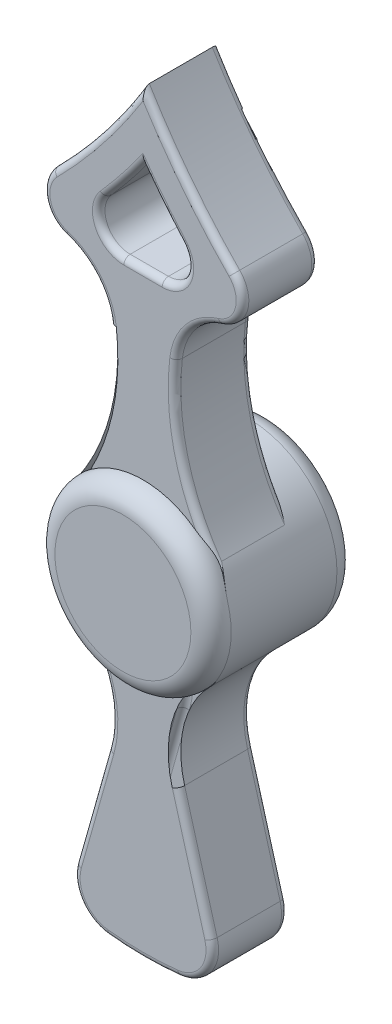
ISO-10303-21;
HEADER;
FILE_DESCRIPTION(('STEP AP214'),'2;1');
FILE_NAME('part.step','',(''),(''),'','','');
FILE_SCHEMA(('AUTOMOTIVE_DESIGN { 1 0 10303 214 1 1 1 1 }'));
ENDSEC;
DATA;
#1=APPLICATION_CONTEXT('core data for automotive mechanical design processes');
#2=APPLICATION_PROTOCOL_DEFINITION('international standard','automotive_design',2000,#1);
#3=PRODUCT_CONTEXT('',#1,'mechanical');
#4=PRODUCT('Part','Part','',(#3));
#5=PRODUCT_RELATED_PRODUCT_CATEGORY('part','',(#4));
#6=PRODUCT_DEFINITION_FORMATION('','',#4);
#7=PRODUCT_DEFINITION_CONTEXT('part definition',#1,'design');
#8=PRODUCT_DEFINITION('design','',#6,#7);
#9=PRODUCT_DEFINITION_SHAPE('','',#8);
#10=(LENGTH_UNIT() NAMED_UNIT(*) SI_UNIT(.MILLI.,.METRE.));
#11=(NAMED_UNIT(*) PLANE_ANGLE_UNIT() SI_UNIT($,.RADIAN.));
#12=(NAMED_UNIT(*) SI_UNIT($,.STERADIAN.) SOLID_ANGLE_UNIT());
#13=UNCERTAINTY_MEASURE_WITH_UNIT(LENGTH_MEASURE(1.E-05),#10,'distance_accuracy_value','');
#14=(GEOMETRIC_REPRESENTATION_CONTEXT(3) GLOBAL_UNCERTAINTY_ASSIGNED_CONTEXT((#13)) GLOBAL_UNIT_ASSIGNED_CONTEXT((#10,
#11,#12)) REPRESENTATION_CONTEXT('',''));
#15=CARTESIAN_POINT('',(0.,0.,0.));
#16=DIRECTION('',(0.,0.,1.));
#17=DIRECTION('',(1.,0.,0.));
#18=AXIS2_PLACEMENT_3D('',#15,#16,#17);
#19=CARTESIAN_POINT('',(0.,0.,3.));
#20=DIRECTION('',(0.,0.,1.));
#21=DIRECTION('',(1.,0.,0.));
#22=AXIS2_PLACEMENT_3D('',#19,#20,#21);
#23=PLANE('',#22);
#24=CARTESIAN_POINT('',(-0.759988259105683,11.75,3.));
#25=DIRECTION('',(0.,0.,1.));
#26=DIRECTION('',(1.,0.,0.));
#27=AXIS2_PLACEMENT_3D('',#24,#25,#26);
#28=CIRCLE('',#27,1.25);
#29=CARTESIAN_POINT('',(-0.759988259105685,10.5,3.));
#30=VERTEX_POINT('',#29);
#31=CARTESIAN_POINT('',(-1.69833582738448,12.5758352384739,3.));
#32=VERTEX_POINT('',#31);
#33=EDGE_CURVE('E429',#30,#32,#28,.F.);
#34=ORIENTED_EDGE('',*,*,#33,.T.);
#35=CARTESIAN_POINT('',(-21.403634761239,29.9183752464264,3.));
#36=DIRECTION('',(0.,0.,1.));
#37=DIRECTION('',(1.,0.,0.));
#38=AXIS2_PLACEMENT_3D('',#35,#36,#37);
#39=CIRCLE('',#38,26.25);
#40=CARTESIAN_POINT('',(0.,14.7214374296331,3.));
#41=VERTEX_POINT('',#40);
#42=EDGE_CURVE('E437',#32,#41,#39,.T.);
#43=ORIENTED_EDGE('',*,*,#42,.T.);
#44=CARTESIAN_POINT('',(21.403634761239,29.9183752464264,3.));
#45=DIRECTION('',(0.,0.,1.));
#46=DIRECTION('',(1.,0.,0.));
#47=AXIS2_PLACEMENT_3D('',#44,#45,#46);
#48=CIRCLE('',#47,26.25);
#49=CARTESIAN_POINT('',(1.69833582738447,12.5758352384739,3.));
#50=VERTEX_POINT('',#49);
#51=EDGE_CURVE('E435',#41,#50,#48,.T.);
#52=ORIENTED_EDGE('',*,*,#51,.T.);
#53=CARTESIAN_POINT('',(0.759988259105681,11.75,3.));
#54=DIRECTION('',(0.,0.,1.));
#55=DIRECTION('',(1.,0.,0.));
#56=AXIS2_PLACEMENT_3D('',#53,#54,#55);
#57=CIRCLE('',#56,1.25);
#58=CARTESIAN_POINT('',(0.759988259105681,10.5,3.));
#59=VERTEX_POINT('',#58);
#60=EDGE_CURVE('E433',#50,#59,#57,.F.);
#61=ORIENTED_EDGE('',*,*,#60,.T.);
#62=DIRECTION('',(1.,0.,0.));
#63=VECTOR('',#62,1.);
#64=CARTESIAN_POINT('',(0.,10.5,3.));
#65=LINE('',#64,#63);
#66=EDGE_CURVE('E431',#59,#30,#65,.F.);
#67=ORIENTED_EDGE('',*,*,#66,.T.);
#68=EDGE_LOOP('',(#34,#43,#52,#61,#67));
#69=FACE_BOUND('',#68,.T.);
#70=CARTESIAN_POINT('',(-3.79443240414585,7.91325806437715,3.));
#71=DIRECTION('',(0.,0.,1.));
#72=DIRECTION('',(1.,0.,0.));
#73=AXIS2_PLACEMENT_3D('',#70,#71,#72);
#74=CIRCLE('',#73,2.75);
#75=CARTESIAN_POINT('',(-2.99184864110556,10.5435354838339,3.));
#76=VERTEX_POINT('',#75);
#77=CARTESIAN_POINT('',(-1.06323072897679,8.23425247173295,3.));
#78=VERTEX_POINT('',#77);
#79=EDGE_CURVE('E425',#76,#78,#74,.F.);
#80=ORIENTED_EDGE('',*,*,#79,.T.);
#81=CARTESIAN_POINT('',(-10.25,7.15454401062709,3.));
#82=DIRECTION('',(0.,0.,1.));
#83=DIRECTION('',(1.,0.,0.));
#84=AXIS2_PLACEMENT_3D('',#81,#82,#83);
#85=CIRCLE('',#84,9.25);
#86=CARTESIAN_POINT('',(-2.08191607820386,2.81347213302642,3.));
#87=VERTEX_POINT('',#86);
#88=EDGE_CURVE('E427',#78,#87,#85,.F.);
#89=ORIENTED_EDGE('',*,*,#88,.T.);
#90=CARTESIAN_POINT('',(0.,0.,3.));
#91=DIRECTION('',(0.,0.,1.));
#92=DIRECTION('',(1.,0.,0.));
#93=AXIS2_PLACEMENT_3D('',#90,#91,#92);
#94=CIRCLE('',#93,3.5);
#95=CARTESIAN_POINT('',(2.08191607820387,2.81347213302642,3.));
#96=VERTEX_POINT('',#95);
#97=EDGE_CURVE('E335',#96,#87,#94,.T.);
#98=ORIENTED_EDGE('',*,*,#97,.F.);
#99=CARTESIAN_POINT('',(10.25,7.1545440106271,3.));
#100=DIRECTION('',(0.,0.,1.));
#101=DIRECTION('',(1.,0.,0.));
#102=AXIS2_PLACEMENT_3D('',#99,#100,#101);
#103=CIRCLE('',#102,9.25);
#104=CARTESIAN_POINT('',(1.06323072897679,8.23425247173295,3.));
#105=VERTEX_POINT('',#104);
#106=EDGE_CURVE('E412',#96,#105,#103,.F.);
#107=ORIENTED_EDGE('',*,*,#106,.T.);
#108=CARTESIAN_POINT('',(3.79443240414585,7.91325806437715,3.));
#109=DIRECTION('',(0.,0.,1.));
#110=DIRECTION('',(1.,0.,0.));
#111=AXIS2_PLACEMENT_3D('',#108,#109,#110);
#112=CIRCLE('',#111,2.75);
#113=CARTESIAN_POINT('',(2.99184864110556,10.5435354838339,3.));
#114=VERTEX_POINT('',#113);
#115=EDGE_CURVE('E414',#105,#114,#112,.F.);
#116=ORIENTED_EDGE('',*,*,#115,.T.);
#117=CARTESIAN_POINT('',(2.7,11.5,3.));
#118=DIRECTION('',(0.,0.,1.));
#119=DIRECTION('',(1.,0.,0.));
#120=AXIS2_PLACEMENT_3D('',#117,#118,#119);
#121=CIRCLE('',#120,1.);
#122=CARTESIAN_POINT('',(3.41251941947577,12.2016523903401,3.));
#123=VERTEX_POINT('',#122);
#124=EDGE_CURVE('E416',#114,#123,#121,.T.);
#125=ORIENTED_EDGE('',*,*,#124,.T.);
#126=CARTESIAN_POINT('',(21.403634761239,29.9183752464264,3.));
#127=DIRECTION('',(0.,0.,1.));
#128=DIRECTION('',(1.,0.,0.));
#129=AXIS2_PLACEMENT_3D('',#126,#127,#128);
#130=CIRCLE('',#129,25.25);
#131=CARTESIAN_POINT('',(0.,16.5225953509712,3.));
#132=VERTEX_POINT('',#131);
#133=EDGE_CURVE('E418',#123,#132,#130,.F.);
#134=ORIENTED_EDGE('',*,*,#133,.T.);
#135=CARTESIAN_POINT('',(-21.403634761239,29.9183752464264,3.));
#136=DIRECTION('',(0.,0.,1.));
#137=DIRECTION('',(1.,0.,0.));
#138=AXIS2_PLACEMENT_3D('',#135,#136,#137);
#139=CIRCLE('',#138,25.25);
#140=CARTESIAN_POINT('',(-3.41251941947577,12.2016523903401,3.));
#141=VERTEX_POINT('',#140);
#142=EDGE_CURVE('E420',#132,#141,#139,.F.);
#143=ORIENTED_EDGE('',*,*,#142,.T.);
#144=CARTESIAN_POINT('',(-2.7,11.5,3.));
#145=DIRECTION('',(0.,0.,1.));
#146=DIRECTION('',(1.,0.,0.));
#147=AXIS2_PLACEMENT_3D('',#144,#145,#146);
#148=CIRCLE('',#147,1.);
#149=EDGE_CURVE('E423',#141,#76,#148,.T.);
#150=ORIENTED_EDGE('',*,*,#149,.T.);
#151=EDGE_LOOP('',(#80,#89,#98,#107,#116,#125,#134,#143,#150));
#152=FACE_BOUND('',#151,.T.);
#153=ADVANCED_FACE('F31',(#69,#152),#23,.T.);
#154=CARTESIAN_POINT('',(0.,0.,0.));
#155=DIRECTION('',(0.,0.,1.));
#156=DIRECTION('',(1.,0.,0.));
#157=AXIS2_PLACEMENT_3D('',#154,#155,#156);
#158=PLANE('',#157);
#159=CARTESIAN_POINT('',(21.403634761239,29.9183752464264,0.));
#160=DIRECTION('',(0.,0.,1.));
#161=DIRECTION('',(1.,0.,0.));
#162=AXIS2_PLACEMENT_3D('',#159,#160,#161);
#163=CIRCLE('',#162,26.25);
#164=CARTESIAN_POINT('',(1.69833582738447,12.5758352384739,0.));
#165=VERTEX_POINT('',#164);
#166=CARTESIAN_POINT('',(0.,14.7214374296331,0.));
#167=VERTEX_POINT('',#166);
#168=EDGE_CURVE('E465',#165,#167,#163,.F.);
#169=ORIENTED_EDGE('',*,*,#168,.T.);
#170=CARTESIAN_POINT('',(-21.403634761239,29.9183752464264,0.));
#171=DIRECTION('',(0.,0.,1.));
#172=DIRECTION('',(1.,0.,0.));
#173=AXIS2_PLACEMENT_3D('',#170,#171,#172);
#174=CIRCLE('',#173,26.25);
#175=CARTESIAN_POINT('',(-1.69833582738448,12.5758352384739,0.));
#176=VERTEX_POINT('',#175);
#177=EDGE_CURVE('E467',#167,#176,#174,.F.);
#178=ORIENTED_EDGE('',*,*,#177,.T.);
#179=CARTESIAN_POINT('',(-0.759988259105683,11.75,0.));
#180=DIRECTION('',(0.,0.,1.));
#181=DIRECTION('',(1.,0.,0.));
#182=AXIS2_PLACEMENT_3D('',#179,#180,#181);
#183=CIRCLE('',#182,1.25);
#184=CARTESIAN_POINT('',(-0.759988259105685,10.5,0.));
#185=VERTEX_POINT('',#184);
#186=EDGE_CURVE('E459',#176,#185,#183,.T.);
#187=ORIENTED_EDGE('',*,*,#186,.T.);
#188=DIRECTION('',(1.,0.,0.));
#189=VECTOR('',#188,1.);
#190=CARTESIAN_POINT('',(0.75998825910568,10.5,0.));
#191=LINE('',#190,#189);
#192=CARTESIAN_POINT('',(0.759988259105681,10.5,0.));
#193=VERTEX_POINT('',#192);
#194=EDGE_CURVE('E461',#185,#193,#191,.T.);
#195=ORIENTED_EDGE('',*,*,#194,.T.);
#196=CARTESIAN_POINT('',(0.759988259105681,11.75,0.));
#197=DIRECTION('',(0.,0.,1.));
#198=DIRECTION('',(1.,0.,0.));
#199=AXIS2_PLACEMENT_3D('',#196,#197,#198);
#200=CIRCLE('',#199,1.25);
#201=EDGE_CURVE('E463',#193,#165,#200,.T.);
#202=ORIENTED_EDGE('',*,*,#201,.T.);
#203=EDGE_LOOP('',(#169,#178,#187,#195,#202));
#204=FACE_BOUND('',#203,.T.);
#205=CARTESIAN_POINT('',(-21.403634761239,29.9183752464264,0.));
#206=DIRECTION('',(0.,0.,-1.));
#207=DIRECTION('',(1.,0.,0.));
#208=AXIS2_PLACEMENT_3D('',#205,#206,#207);
#209=CIRCLE('',#208,25.);
#210=CARTESIAN_POINT('',(-0.146733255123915,16.7599506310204,0.));
#211=VERTEX_POINT('',#210);
#212=CARTESIAN_POINT('',(-3.59064927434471,12.3770654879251,0.));
#213=VERTEX_POINT('',#212);
#214=EDGE_CURVE('E945',#211,#213,#209,.T.);
#215=ORIENTED_EDGE('',*,*,#214,.F.);
#216=CARTESIAN_POINT('',(21.403634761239,29.9183752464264,0.));
#217=DIRECTION('',(0.,0.,1.));
#218=DIRECTION('',(1.,0.,0.));
#219=AXIS2_PLACEMENT_3D('',#216,#217,#218);
#220=CIRCLE('',#219,25.25);
#221=CARTESIAN_POINT('',(3.41251941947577,12.2016523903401,0.));
#222=VERTEX_POINT('',#221);
#223=EDGE_CURVE('E457',#211,#222,#220,.T.);
#224=ORIENTED_EDGE('',*,*,#223,.T.);
#225=CARTESIAN_POINT('',(2.7,11.5,0.));
#226=DIRECTION('',(0.,0.,1.));
#227=DIRECTION('',(1.,0.,0.));
#228=AXIS2_PLACEMENT_3D('',#225,#226,#227);
#229=CIRCLE('',#228,1.);
#230=CARTESIAN_POINT('',(2.99184864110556,10.5435354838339,0.));
#231=VERTEX_POINT('',#230);
#232=EDGE_CURVE('E455',#222,#231,#229,.F.);
#233=ORIENTED_EDGE('',*,*,#232,.T.);
#234=CARTESIAN_POINT('',(3.79443240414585,7.91325806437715,0.));
#235=DIRECTION('',(0.,0.,1.));
#236=DIRECTION('',(1.,0.,0.));
#237=AXIS2_PLACEMENT_3D('',#234,#235,#236);
#238=CIRCLE('',#237,2.75);
#239=CARTESIAN_POINT('',(1.06323072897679,8.23425247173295,0.));
#240=VERTEX_POINT('',#239);
#241=EDGE_CURVE('E453',#231,#240,#238,.T.);
#242=ORIENTED_EDGE('',*,*,#241,.T.);
#243=CARTESIAN_POINT('',(10.25,7.1545440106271,0.));
#244=DIRECTION('',(0.,0.,1.));
#245=DIRECTION('',(1.,0.,0.));
#246=AXIS2_PLACEMENT_3D('',#243,#244,#245);
#247=CIRCLE('',#246,9.25);
#248=CARTESIAN_POINT('',(2.08191607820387,2.81347213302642,0.));
#249=VERTEX_POINT('',#248);
#250=EDGE_CURVE('E334',#240,#249,#247,.T.);
#251=ORIENTED_EDGE('',*,*,#250,.T.);
#252=CARTESIAN_POINT('',(0.,0.,0.));
#253=DIRECTION('',(0.,0.,1.));
#254=DIRECTION('',(1.,0.,0.));
#255=AXIS2_PLACEMENT_3D('',#252,#253,#254);
#256=CIRCLE('',#255,3.5);
#257=CARTESIAN_POINT('',(-2.87,2.00327232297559,0.));
#258=VERTEX_POINT('',#257);
#259=EDGE_CURVE('E318',#249,#258,#256,.T.);
#260=ORIENTED_EDGE('',*,*,#259,.T.);
#261=CARTESIAN_POINT('',(-10.25,7.15454401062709,0.));
#262=DIRECTION('',(0.,0.,-1.));
#263=DIRECTION('',(1.,0.,0.));
#264=AXIS2_PLACEMENT_3D('',#261,#262,#263);
#265=CIRCLE('',#264,9.);
#266=CARTESIAN_POINT('',(-1.31152179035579,8.20507116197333,0.));
#267=VERTEX_POINT('',#266);
#268=EDGE_CURVE('E326',#267,#258,#265,.T.);
#269=ORIENTED_EDGE('',*,*,#268,.F.);
#270=CARTESIAN_POINT('',(-3.79443240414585,7.91325806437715,0.));
#271=DIRECTION('',(0.,0.,-1.));
#272=DIRECTION('',(1.,0.,0.));
#273=AXIS2_PLACEMENT_3D('',#270,#271,#272);
#274=CIRCLE('',#273,2.5);
#275=CARTESIAN_POINT('',(-3.06481080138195,10.3044193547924,0.));
#276=VERTEX_POINT('',#275);
#277=EDGE_CURVE('E342',#276,#267,#274,.T.);
#278=ORIENTED_EDGE('',*,*,#277,.F.);
#279=CARTESIAN_POINT('',(-2.7,11.5,0.));
#280=DIRECTION('',(0.,0.,1.));
#281=DIRECTION('',(1.,0.,0.));
#282=AXIS2_PLACEMENT_3D('',#279,#280,#281);
#283=CIRCLE('',#282,1.25);
#284=EDGE_CURVE('E344',#213,#276,#283,.T.);
#285=ORIENTED_EDGE('',*,*,#284,.F.);
#286=EDGE_LOOP('',(#215,#224,#233,#242,#251,#260,#269,#278,#285));
#287=FACE_BOUND('',#286,.T.);
#288=ADVANCED_FACE('F331',(#204,#287),#158,.F.);
#289=CARTESIAN_POINT('',(-1.66004054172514,-3.08127658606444,3.));
#290=VERTEX_POINT('',#289);
#291=CARTESIAN_POINT('',(1.66004054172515,-3.08127658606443,3.));
#292=VERTEX_POINT('',#291);
#293=EDGE_CURVE('E336',#290,#292,#94,.T.);
#294=ORIENTED_EDGE('',*,*,#293,.F.);
#295=CARTESIAN_POINT('',(-5.25,-5.35607132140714,3.));
#296=DIRECTION('',(0.,0.,1.));
#297=DIRECTION('',(1.,0.,0.));
#298=AXIS2_PLACEMENT_3D('',#295,#296,#297);
#299=CIRCLE('',#298,4.25);
#300=CARTESIAN_POINT('',(-1.1597987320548,-6.51052079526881,3.));
#301=VERTEX_POINT('',#300);
#302=EDGE_CURVE('E691',#290,#301,#299,.F.);
#303=ORIENTED_EDGE('',*,*,#302,.T.);
#304=DIRECTION('',(-0.271635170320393,-0.962400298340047,0.));
#305=VECTOR('',#304,1.);
#306=CARTESIAN_POINT('',(-2.45300037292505,-11.0923194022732,3.));
#307=LINE('',#306,#305);
#308=CARTESIAN_POINT('',(-2.45300037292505,-11.0923194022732,3.));
#309=VERTEX_POINT('',#308);
#310=EDGE_CURVE('E53',#301,#309,#307,.T.);
#311=ORIENTED_EDGE('',*,*,#310,.T.);
#312=CARTESIAN_POINT('',(-1.25,-11.4318633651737,3.));
#313=DIRECTION('',(0.,0.,1.));
#314=DIRECTION('',(1.,0.,0.));
#315=AXIS2_PLACEMENT_3D('',#312,#313,#314);
#316=CIRCLE('',#315,1.25);
#317=CARTESIAN_POINT('',(-1.38586956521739,-12.6744572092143,3.));
#318=VERTEX_POINT('',#317);
#319=EDGE_CURVE('E704',#309,#318,#316,.T.);
#320=ORIENTED_EDGE('',*,*,#319,.T.);
#321=CARTESIAN_POINT('',(0.,0.,3.));
#322=DIRECTION('',(0.,0.,1.));
#323=DIRECTION('',(1.,0.,0.));
#324=AXIS2_PLACEMENT_3D('',#321,#322,#323);
#325=CIRCLE('',#324,12.75);
#326=CARTESIAN_POINT('',(1.38586956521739,-12.6744572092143,3.));
#327=VERTEX_POINT('',#326);
#328=EDGE_CURVE('E789',#318,#327,#325,.T.);
#329=ORIENTED_EDGE('',*,*,#328,.T.);
#330=CARTESIAN_POINT('',(1.25,-11.4318633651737,3.));
#331=DIRECTION('',(0.,0.,1.));
#332=DIRECTION('',(1.,0.,0.));
#333=AXIS2_PLACEMENT_3D('',#330,#331,#332);
#334=CIRCLE('',#333,1.25);
#335=CARTESIAN_POINT('',(2.45300037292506,-11.0923194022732,3.));
#336=VERTEX_POINT('',#335);
#337=EDGE_CURVE('E787',#327,#336,#334,.T.);
#338=ORIENTED_EDGE('',*,*,#337,.T.);
#339=DIRECTION('',(-0.271635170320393,0.962400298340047,0.));
#340=VECTOR('',#339,1.);
#341=CARTESIAN_POINT('',(1.1597987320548,-6.51052079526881,3.));
#342=LINE('',#341,#340);
#343=CARTESIAN_POINT('',(1.1597987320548,-6.51052079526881,3.));
#344=VERTEX_POINT('',#343);
#345=EDGE_CURVE('E783',#336,#344,#342,.T.);
#346=ORIENTED_EDGE('',*,*,#345,.T.);
#347=CARTESIAN_POINT('',(5.25,-5.35607132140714,3.));
#348=DIRECTION('',(0.,0.,1.));
#349=DIRECTION('',(1.,0.,0.));
#350=AXIS2_PLACEMENT_3D('',#347,#348,#349);
#351=CIRCLE('',#350,4.25);
#352=EDGE_CURVE('E693',#344,#292,#351,.F.);
#353=ORIENTED_EDGE('',*,*,#352,.T.);
#354=EDGE_LOOP('',(#294,#303,#311,#320,#329,#338,#346,#353));
#355=FACE_BOUND('',#354,.T.);
#356=ADVANCED_FACE('F674',(#355),#23,.T.);
#357=DIRECTION('',(-0.271635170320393,-0.962400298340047,0.));
#358=VECTOR('',#357,1.);
#359=CARTESIAN_POINT('',(0.627769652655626,-0.177186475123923,0.));
#360=LINE('',#359,#358);
#361=CARTESIAN_POINT('',(-2.45300037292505,-11.0923194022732,0.));
#362=VERTEX_POINT('',#361);
#363=CARTESIAN_POINT('',(-1.1597987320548,-6.51052079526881,0.));
#364=VERTEX_POINT('',#363);
#365=EDGE_CURVE('E747',#362,#364,#360,.F.);
#366=ORIENTED_EDGE('',*,*,#365,.T.);
#367=CARTESIAN_POINT('',(-5.25,-5.35607132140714,0.));
#368=DIRECTION('',(0.,0.,1.));
#369=DIRECTION('',(1.,0.,0.));
#370=AXIS2_PLACEMENT_3D('',#367,#368,#369);
#371=CIRCLE('',#370,4.25);
#372=CARTESIAN_POINT('',(-1.66004054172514,-3.08127658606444,0.));
#373=VERTEX_POINT('',#372);
#374=EDGE_CURVE('E749',#364,#373,#371,.T.);
#375=ORIENTED_EDGE('',*,*,#374,.T.);
#376=CARTESIAN_POINT('',(1.66004054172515,-3.08127658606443,0.));
#377=VERTEX_POINT('',#376);
#378=EDGE_CURVE('E338',#373,#377,#256,.T.);
#379=ORIENTED_EDGE('',*,*,#378,.T.);
#380=CARTESIAN_POINT('',(5.25,-5.35607132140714,0.));
#381=DIRECTION('',(0.,0.,1.));
#382=DIRECTION('',(1.,0.,0.));
#383=AXIS2_PLACEMENT_3D('',#380,#381,#382);
#384=CIRCLE('',#383,4.25);
#385=CARTESIAN_POINT('',(1.1597987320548,-6.51052079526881,0.));
#386=VERTEX_POINT('',#385);
#387=EDGE_CURVE('E734',#377,#386,#384,.T.);
#388=ORIENTED_EDGE('',*,*,#387,.T.);
#389=DIRECTION('',(-0.271635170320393,0.962400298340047,0.));
#390=VECTOR('',#389,1.);
#391=CARTESIAN_POINT('',(-0.627769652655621,-0.177186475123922,0.));
#392=LINE('',#391,#390);
#393=CARTESIAN_POINT('',(2.45300037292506,-11.0923194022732,0.));
#394=VERTEX_POINT('',#393);
#395=EDGE_CURVE('E732',#386,#394,#392,.F.);
#396=ORIENTED_EDGE('',*,*,#395,.T.);
#397=CARTESIAN_POINT('',(1.25,-11.4318633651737,0.));
#398=DIRECTION('',(0.,0.,1.));
#399=DIRECTION('',(1.,0.,0.));
#400=AXIS2_PLACEMENT_3D('',#397,#398,#399);
#401=CIRCLE('',#400,1.25);
#402=CARTESIAN_POINT('',(1.38586956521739,-12.6744572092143,0.));
#403=VERTEX_POINT('',#402);
#404=EDGE_CURVE('E741',#394,#403,#401,.F.);
#405=ORIENTED_EDGE('',*,*,#404,.T.);
#406=CARTESIAN_POINT('',(0.,0.,0.));
#407=DIRECTION('',(0.,0.,1.));
#408=DIRECTION('',(1.,0.,0.));
#409=AXIS2_PLACEMENT_3D('',#406,#407,#408);
#410=CIRCLE('',#409,12.75);
#411=CARTESIAN_POINT('',(-1.38586956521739,-12.6744572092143,0.));
#412=VERTEX_POINT('',#411);
#413=EDGE_CURVE('E743',#403,#412,#410,.F.);
#414=ORIENTED_EDGE('',*,*,#413,.T.);
#415=CARTESIAN_POINT('',(-1.25,-11.4318633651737,0.));
#416=DIRECTION('',(0.,0.,1.));
#417=DIRECTION('',(1.,0.,0.));
#418=AXIS2_PLACEMENT_3D('',#415,#416,#417);
#419=CIRCLE('',#418,1.25);
#420=EDGE_CURVE('E745',#412,#362,#419,.F.);
#421=ORIENTED_EDGE('',*,*,#420,.T.);
#422=EDGE_LOOP('',(#366,#375,#379,#388,#396,#405,#414,#421));
#423=FACE_BOUND('',#422,.T.);
#424=ADVANCED_FACE('F680',(#423),#158,.F.);
#425=CARTESIAN_POINT('',(-5.25,-5.35607132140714,3.));
#426=DIRECTION('',(0.,0.,-1.));
#427=DIRECTION('',(-1.,0.,0.));
#428=AXIS2_PLACEMENT_3D('',#425,#426,#427);
#429=CYLINDRICAL_SURFACE('',#428,4.);
#430=DIRECTION('',(0.,0.,-1.));
#431=VECTOR('',#430,1.);
#432=CARTESIAN_POINT('',(-2.45,-2.49949994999,3.));
#433=LINE('',#432,#431);
#434=CARTESIAN_POINT('',(-2.45,-2.49949994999,2.75));
#435=VERTEX_POINT('',#434);
#436=CARTESIAN_POINT('',(-2.45,-2.49949994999,0.25));
#437=VERTEX_POINT('',#436);
#438=EDGE_CURVE('E389',#435,#437,#433,.T.);
#439=ORIENTED_EDGE('',*,*,#438,.T.);
#440=CARTESIAN_POINT('',(-5.25,-5.35607132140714,0.25));
#441=DIRECTION('',(0.,0.,1.));
#442=DIRECTION('',(1.,0.,0.));
#443=AXIS2_PLACEMENT_3D('',#440,#441,#442);
#444=CIRCLE('',#443,4.);
#445=CARTESIAN_POINT('',(-1.40039880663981,-6.44261200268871,0.25));
#446=VERTEX_POINT('',#445);
#447=EDGE_CURVE('E727',#437,#446,#444,.F.);
#448=ORIENTED_EDGE('',*,*,#447,.T.);
#449=DIRECTION('',(0.,0.,-1.));
#450=VECTOR('',#449,1.);
#451=CARTESIAN_POINT('',(-1.40039880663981,-6.44261200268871,3.));
#452=LINE('',#451,#450);
#453=CARTESIAN_POINT('',(-1.40039880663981,-6.44261200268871,2.75));
#454=VERTEX_POINT('',#453);
#455=EDGE_CURVE('E386',#454,#446,#452,.T.);
#456=ORIENTED_EDGE('',*,*,#455,.F.);
#457=CARTESIAN_POINT('',(-5.25,-5.35607132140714,2.75));
#458=DIRECTION('',(0.,0.,1.));
#459=DIRECTION('',(1.,0.,0.));
#460=AXIS2_PLACEMENT_3D('',#457,#458,#459);
#461=CIRCLE('',#460,4.);
#462=EDGE_CURVE('E728',#454,#435,#461,.T.);
#463=ORIENTED_EDGE('',*,*,#462,.T.);
#464=EDGE_LOOP('',(#439,#448,#456,#463));
#465=FACE_BOUND('',#464,.T.);
#466=ADVANCED_FACE('F687',(#465),#429,.F.);
#467=CARTESIAN_POINT('',(-1.40039880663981,-6.44261200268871,3.));
#468=DIRECTION('',(0.962400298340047,-0.271635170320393,0.));
#469=DIRECTION('',(0.271635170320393,0.962400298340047,0.));
#470=AXIS2_PLACEMENT_3D('',#467,#468,#469);
#471=PLANE('',#470);
#472=ORIENTED_EDGE('',*,*,#455,.T.);
#473=DIRECTION('',(-0.271635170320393,-0.962400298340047,0.));
#474=VECTOR('',#473,1.);
#475=CARTESIAN_POINT('',(-1.40039880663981,-6.44261200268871,0.25));
#476=LINE('',#475,#474);
#477=CARTESIAN_POINT('',(-2.69360044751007,-11.0244106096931,0.25));
#478=VERTEX_POINT('',#477);
#479=EDGE_CURVE('E753',#446,#478,#476,.T.);
#480=ORIENTED_EDGE('',*,*,#479,.T.);
#481=DIRECTION('',(0.,0.,-1.));
#482=VECTOR('',#481,1.);
#483=CARTESIAN_POINT('',(-2.69360044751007,-11.0244106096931,3.));
#484=LINE('',#483,#482);
#485=CARTESIAN_POINT('',(-2.69360044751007,-11.0244106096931,2.75));
#486=VERTEX_POINT('',#485);
#487=EDGE_CURVE('E383',#486,#478,#484,.T.);
#488=ORIENTED_EDGE('',*,*,#487,.F.);
#489=DIRECTION('',(-0.271635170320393,-0.962400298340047,0.));
#490=VECTOR('',#489,1.);
#491=CARTESIAN_POINT('',(-1.40039880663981,-6.44261200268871,2.75));
#492=LINE('',#491,#490);
#493=EDGE_CURVE('E751',#486,#454,#492,.F.);
#494=ORIENTED_EDGE('',*,*,#493,.T.);
#495=EDGE_LOOP('',(#472,#480,#488,#494));
#496=FACE_BOUND('',#495,.T.);
#497=ADVANCED_FACE('F808',(#496),#471,.F.);
#498=CARTESIAN_POINT('',(-1.25,-11.4318633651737,3.));
#499=DIRECTION('',(0.,0.,-1.));
#500=DIRECTION('',(-1.,0.,0.));
#501=AXIS2_PLACEMENT_3D('',#498,#499,#500);
#502=CYLINDRICAL_SURFACE('',#501,1.5);
#503=ORIENTED_EDGE('',*,*,#487,.T.);
#504=CARTESIAN_POINT('',(-1.25,-11.4318633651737,0.25));
#505=DIRECTION('',(0.,0.,1.));
#506=DIRECTION('',(1.,0.,0.));
#507=AXIS2_PLACEMENT_3D('',#504,#505,#506);
#508=CIRCLE('',#507,1.5);
#509=CARTESIAN_POINT('',(-1.41304347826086,-12.9229759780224,0.25));
#510=VERTEX_POINT('',#509);
#511=EDGE_CURVE('E757',#478,#510,#508,.T.);
#512=ORIENTED_EDGE('',*,*,#511,.T.);
#513=DIRECTION('',(0.,0.,-1.));
#514=VECTOR('',#513,1.);
#515=CARTESIAN_POINT('',(-1.41304347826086,-12.9229759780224,3.));
#516=LINE('',#515,#514);
#517=CARTESIAN_POINT('',(-1.41304347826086,-12.9229759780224,2.75));
#518=VERTEX_POINT('',#517);
#519=EDGE_CURVE('E380',#518,#510,#516,.T.);
#520=ORIENTED_EDGE('',*,*,#519,.F.);
#521=CARTESIAN_POINT('',(-1.25,-11.4318633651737,2.75));
#522=DIRECTION('',(0.,0.,1.));
#523=DIRECTION('',(1.,0.,0.));
#524=AXIS2_PLACEMENT_3D('',#521,#522,#523);
#525=CIRCLE('',#524,1.5);
#526=EDGE_CURVE('E755',#518,#486,#525,.F.);
#527=ORIENTED_EDGE('',*,*,#526,.T.);
#528=EDGE_LOOP('',(#503,#512,#520,#527));
#529=FACE_BOUND('',#528,.T.);
#530=ADVANCED_FACE('F805',(#529),#502,.T.);
#531=CARTESIAN_POINT('',(0.,0.,3.));
#532=DIRECTION('',(0.,0.,-1.));
#533=DIRECTION('',(-1.,0.,0.));
#534=AXIS2_PLACEMENT_3D('',#531,#532,#533);
#535=CYLINDRICAL_SURFACE('',#534,13.);
#536=ORIENTED_EDGE('',*,*,#519,.T.);
#537=CARTESIAN_POINT('',(0.,0.,0.25));
#538=DIRECTION('',(0.,0.,1.));
#539=DIRECTION('',(1.,0.,0.));
#540=AXIS2_PLACEMENT_3D('',#537,#538,#539);
#541=CIRCLE('',#540,13.);
#542=CARTESIAN_POINT('',(1.41304347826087,-12.9229759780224,0.25));
#543=VERTEX_POINT('',#542);
#544=EDGE_CURVE('E761',#510,#543,#541,.T.);
#545=ORIENTED_EDGE('',*,*,#544,.T.);
#546=DIRECTION('',(0.,0.,-1.));
#547=VECTOR('',#546,1.);
#548=CARTESIAN_POINT('',(1.41304347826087,-12.9229759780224,3.));
#549=LINE('',#548,#547);
#550=CARTESIAN_POINT('',(1.41304347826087,-12.9229759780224,2.75));
#551=VERTEX_POINT('',#550);
#552=EDGE_CURVE('E377',#551,#543,#549,.T.);
#553=ORIENTED_EDGE('',*,*,#552,.F.);
#554=CARTESIAN_POINT('',(0.,0.,2.75));
#555=DIRECTION('',(0.,0.,1.));
#556=DIRECTION('',(1.,0.,0.));
#557=AXIS2_PLACEMENT_3D('',#554,#555,#556);
#558=CIRCLE('',#557,13.);
#559=EDGE_CURVE('E759',#551,#518,#558,.F.);
#560=ORIENTED_EDGE('',*,*,#559,.T.);
#561=EDGE_LOOP('',(#536,#545,#553,#560));
#562=FACE_BOUND('',#561,.T.);
#563=ADVANCED_FACE('F1484',(#562),#535,.T.);
#564=CARTESIAN_POINT('',(1.25,-11.4318633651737,3.));
#565=DIRECTION('',(0.,0.,-1.));
#566=DIRECTION('',(-1.,0.,0.));
#567=AXIS2_PLACEMENT_3D('',#564,#565,#566);
#568=CYLINDRICAL_SURFACE('',#567,1.5);
#569=ORIENTED_EDGE('',*,*,#552,.T.);
#570=CARTESIAN_POINT('',(1.25,-11.4318633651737,0.25));
#571=DIRECTION('',(0.,0.,1.));
#572=DIRECTION('',(1.,0.,0.));
#573=AXIS2_PLACEMENT_3D('',#570,#571,#572);
#574=CIRCLE('',#573,1.5);
#575=CARTESIAN_POINT('',(2.69360044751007,-11.0244106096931,0.25));
#576=VERTEX_POINT('',#575);
#577=EDGE_CURVE('E765',#543,#576,#574,.T.);
#578=ORIENTED_EDGE('',*,*,#577,.T.);
#579=DIRECTION('',(0.,0.,-1.));
#580=VECTOR('',#579,1.);
#581=CARTESIAN_POINT('',(2.69360044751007,-11.0244106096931,3.));
#582=LINE('',#581,#580);
#583=CARTESIAN_POINT('',(2.69360044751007,-11.0244106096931,2.75));
#584=VERTEX_POINT('',#583);
#585=EDGE_CURVE('E374',#584,#576,#582,.T.);
#586=ORIENTED_EDGE('',*,*,#585,.F.);
#587=CARTESIAN_POINT('',(1.25,-11.4318633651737,2.75));
#588=DIRECTION('',(0.,0.,1.));
#589=DIRECTION('',(1.,0.,0.));
#590=AXIS2_PLACEMENT_3D('',#587,#588,#589);
#591=CIRCLE('',#590,1.5);
#592=EDGE_CURVE('E763',#584,#551,#591,.F.);
#593=ORIENTED_EDGE('',*,*,#592,.T.);
#594=EDGE_LOOP('',(#569,#578,#586,#593));
#595=FACE_BOUND('',#594,.T.);
#596=ADVANCED_FACE('F1476',(#595),#568,.T.);
#597=CARTESIAN_POINT('',(1.40039880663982,-6.44261200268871,3.));
#598=DIRECTION('',(-0.962400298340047,-0.271635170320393,0.));
#599=DIRECTION('',(0.271635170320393,-0.962400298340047,0.));
#600=AXIS2_PLACEMENT_3D('',#597,#598,#599);
#601=PLANE('',#600);
#602=DIRECTION('',(0.,0.,-1.));
#603=VECTOR('',#602,1.);
#604=CARTESIAN_POINT('',(1.40039880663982,-6.44261200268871,3.));
#605=LINE('',#604,#603);
#606=CARTESIAN_POINT('',(1.40039880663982,-6.44261200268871,2.75));
#607=VERTEX_POINT('',#606);
#608=CARTESIAN_POINT('',(1.40039880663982,-6.44261200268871,0.25));
#609=VERTEX_POINT('',#608);
#610=EDGE_CURVE('E371',#607,#609,#605,.T.);
#611=ORIENTED_EDGE('',*,*,#610,.F.);
#612=DIRECTION('',(-0.271635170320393,0.962400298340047,0.));
#613=VECTOR('',#612,1.);
#614=CARTESIAN_POINT('',(2.69360044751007,-11.0244106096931,2.75));
#615=LINE('',#614,#613);
#616=EDGE_CURVE('E702',#607,#584,#615,.F.);
#617=ORIENTED_EDGE('',*,*,#616,.T.);
#618=ORIENTED_EDGE('',*,*,#585,.T.);
#619=DIRECTION('',(-0.271635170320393,0.962400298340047,0.));
#620=VECTOR('',#619,1.);
#621=CARTESIAN_POINT('',(1.40039880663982,-6.44261200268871,0.25));
#622=LINE('',#621,#620);
#623=EDGE_CURVE('E700',#576,#609,#622,.T.);
#624=ORIENTED_EDGE('',*,*,#623,.T.);
#625=EDGE_LOOP('',(#611,#617,#618,#624));
#626=FACE_BOUND('',#625,.T.);
#627=ADVANCED_FACE('F1033',(#626),#601,.F.);
#628=CARTESIAN_POINT('',(5.25,-5.35607132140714,3.));
#629=DIRECTION('',(0.,0.,-1.));
#630=DIRECTION('',(-1.,0.,0.));
#631=AXIS2_PLACEMENT_3D('',#628,#629,#630);
#632=CYLINDRICAL_SURFACE('',#631,4.);
#633=ORIENTED_EDGE('',*,*,#610,.T.);
#634=CARTESIAN_POINT('',(5.25,-5.35607132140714,0.25));
#635=DIRECTION('',(0.,0.,1.));
#636=DIRECTION('',(1.,0.,0.));
#637=AXIS2_PLACEMENT_3D('',#634,#635,#636);
#638=CIRCLE('',#637,4.);
#639=CARTESIAN_POINT('',(2.45000000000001,-2.49949994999,0.25));
#640=VERTEX_POINT('',#639);
#641=EDGE_CURVE('E769',#609,#640,#638,.F.);
#642=ORIENTED_EDGE('',*,*,#641,.T.);
#643=DIRECTION('',(0.,0.,-1.));
#644=VECTOR('',#643,1.);
#645=CARTESIAN_POINT('',(2.45000000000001,-2.49949994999,3.));
#646=LINE('',#645,#644);
#647=CARTESIAN_POINT('',(2.45000000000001,-2.49949994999,2.75));
#648=VERTEX_POINT('',#647);
#649=EDGE_CURVE('E368',#648,#640,#646,.T.);
#650=ORIENTED_EDGE('',*,*,#649,.F.);
#651=CARTESIAN_POINT('',(5.25,-5.35607132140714,2.75));
#652=DIRECTION('',(0.,0.,1.));
#653=DIRECTION('',(1.,0.,0.));
#654=AXIS2_PLACEMENT_3D('',#651,#652,#653);
#655=CIRCLE('',#654,4.);
#656=EDGE_CURVE('E767',#648,#607,#655,.T.);
#657=ORIENTED_EDGE('',*,*,#656,.T.);
#658=EDGE_LOOP('',(#633,#642,#650,#657));
#659=FACE_BOUND('',#658,.T.);
#660=ADVANCED_FACE('F517',(#659),#632,.F.);
#661=CARTESIAN_POINT('',(0.,0.,3.));
#662=DIRECTION('',(0.,0.,-1.));
#663=DIRECTION('',(-1.,0.,0.));
#664=AXIS2_PLACEMENT_3D('',#661,#662,#663);
#665=CYLINDRICAL_SURFACE('',#664,3.5);
#666=CARTESIAN_POINT('',(0.,0.,-1.2));
#667=DIRECTION('',(0.,0.,1.));
#668=DIRECTION('',(1.,0.,0.));
#669=AXIS2_PLACEMENT_3D('',#666,#667,#668);
#670=CIRCLE('',#669,3.5);
#671=CARTESIAN_POINT('',(3.5,0.,-1.2));
#672=VERTEX_POINT('',#671);
#673=EDGE_CURVE('E397',#672,#672,#670,.T.);
#674=ORIENTED_EDGE('',*,*,#673,.T.);
#675=EDGE_LOOP('',(#674));
#676=FACE_BOUND('',#675,.T.);
#677=CARTESIAN_POINT('',(0.,0.,3.));
#678=DIRECTION('',(0.,0.,1.));
#679=DIRECTION('',(1.,0.,0.));
#680=AXIS2_PLACEMENT_3D('',#677,#678,#679);
#681=CIRCLE('',#680,3.5);
#682=CARTESIAN_POINT('',(-3.04745945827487,-1.72133403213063,3.));
#683=VERTEX_POINT('',#682);
#684=CARTESIAN_POINT('',(-3.35878392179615,0.984159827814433,3.));
#685=VERTEX_POINT('',#684);
#686=EDGE_CURVE('E395',#683,#685,#681,.F.);
#687=ORIENTED_EDGE('',*,*,#686,.T.);
#688=CARTESIAN_POINT('',(-3.35878392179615,0.984159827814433,3.));
#689=CARTESIAN_POINT('',(-3.35281396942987,1.0045353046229,2.99999613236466));
#690=CARTESIAN_POINT('',(-3.34666007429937,1.02484949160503,2.9994988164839));
#691=CARTESIAN_POINT('',(-3.33399851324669,1.06531816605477,2.99763899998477));
#692=CARTESIAN_POINT('',(-3.32749100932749,1.08547272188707,2.99627689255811));
#693=CARTESIAN_POINT('',(-3.30747830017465,1.14558654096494,2.99108215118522));
#694=CARTESIAN_POINT('',(-3.29345827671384,1.18527988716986,2.98614007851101));
#695=CARTESIAN_POINT('',(-3.26419963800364,1.26362245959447,2.97403422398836));
#696=CARTESIAN_POINT('',(-3.24896745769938,1.30227591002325,2.96688166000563));
#697=CARTESIAN_POINT('',(-3.21726875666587,1.37872935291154,2.95084890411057));
#698=CARTESIAN_POINT('',(-3.20080149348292,1.41652881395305,2.94196766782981));
#699=CARTESIAN_POINT('',(-3.13997496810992,1.54973074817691,2.90797918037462));
#700=CARTESIAN_POINT('',(-3.09229838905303,1.64269836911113,2.87923115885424));
#701=CARTESIAN_POINT('',(-2.98947884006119,1.82313280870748,2.81800910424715));
#702=CARTESIAN_POINT('',(-2.93432939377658,1.91059475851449,2.7855318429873));
#703=CARTESIAN_POINT('',(-2.87365041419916,1.99803488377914,2.75201078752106));
#704=CARTESIAN_POINT('',(-2.87182698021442,2.00065486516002,2.75100538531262));
#705=CARTESIAN_POINT('',(-2.87,2.00327232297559,2.75));
#706=B_SPLINE_CURVE_WITH_KNOTS('',3,(#688,#689,#690,#691,#692,#693,#694,#695,#696,#697,#698,
#699,#700,#701,#702,#703,#704,#705),.UNSPECIFIED.,.F.,.F.,(4,2,2,2,2,2,2,2,4),(0.,
0.0636786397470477,0.127328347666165,0.254366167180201,0.38076959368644,0.507249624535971,
0.831679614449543,1.15639259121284,1.16643252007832),.UNSPECIFIED.);
#707=CARTESIAN_POINT('',(-2.87,2.00327232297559,2.75));
#708=VERTEX_POINT('',#707);
#709=EDGE_CURVE('E321',#685,#708,#706,.T.);
#710=ORIENTED_EDGE('',*,*,#709,.T.);
#711=DIRECTION('',(0.,0.,-1.));
#712=VECTOR('',#711,1.);
#713=CARTESIAN_POINT('',(-2.87,2.00327232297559,3.));
#714=LINE('',#713,#712);
#715=EDGE_CURVE('E314',#708,#258,#714,.T.);
#716=ORIENTED_EDGE('',*,*,#715,.T.);
#717=ORIENTED_EDGE('',*,*,#259,.F.);
#718=CARTESIAN_POINT('',(2.08191607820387,2.81347213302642,0.));
#719=CARTESIAN_POINT('',(2.09898361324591,2.80084281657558,3.86763533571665E-06));
#720=CARTESIAN_POINT('',(2.11593019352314,2.78806197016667,0.000501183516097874));
#721=CARTESIAN_POINT('',(2.14955146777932,2.76222326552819,0.00236100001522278));
#722=CARTESIAN_POINT('',(2.16622628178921,2.7491655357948,0.0037231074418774));
#723=CARTESIAN_POINT('',(2.21575330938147,2.70965283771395,0.00891784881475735));
#724=CARTESIAN_POINT('',(2.24817840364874,2.68280630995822,0.0138599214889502));
#725=CARTESIAN_POINT('',(2.31162833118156,2.6283294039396,0.0259657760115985));
#726=CARTESIAN_POINT('',(2.34265934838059,2.60070360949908,0.0331183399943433));
#727=CARTESIAN_POINT('',(2.40349466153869,2.54458764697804,0.0491510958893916));
#728=CARTESIAN_POINT('',(2.4332982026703,2.51609696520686,0.058032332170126));
#729=CARTESIAN_POINT('',(2.53735869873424,2.41307252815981,0.0920208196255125));
#730=CARTESIAN_POINT('',(2.60818630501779,2.33626442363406,0.120768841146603));
#731=CARTESIAN_POINT('',(2.74210363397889,2.17753636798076,0.181990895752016));
#732=CARTESIAN_POINT('',(2.80518655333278,2.09561201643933,0.214468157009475));
#733=CARTESIAN_POINT('',(2.86634240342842,2.00850474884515,0.247989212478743));
#734=CARTESIAN_POINT('',(2.86817299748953,2.00588976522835,0.248994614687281));
#735=CARTESIAN_POINT('',(2.87000000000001,2.00327232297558,0.25));
#736=B_SPLINE_CURVE_WITH_KNOTS('',3,(#718,#719,#720,#721,#722,#723,#724,#725,#726,#727,#728,
#729,#730,#731,#732,#733,#734,#735),.UNSPECIFIED.,.F.,.F.,(4,2,2,2,2,2,2,2,4),(0.,
0.0636786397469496,0.12732834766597,0.254366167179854,0.380769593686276,0.507249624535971,
0.831679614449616,1.15639259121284,1.16643252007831),.UNSPECIFIED.);
#737=CARTESIAN_POINT('',(2.87000000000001,2.00327232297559,0.25));
#738=VERTEX_POINT('',#737);
#739=EDGE_CURVE('E991',#249,#738,#736,.T.);
#740=ORIENTED_EDGE('',*,*,#739,.T.);
#741=DIRECTION('',(0.,0.,-1.));
#742=VECTOR('',#741,1.);
#743=CARTESIAN_POINT('',(2.87000000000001,2.00327232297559,3.));
#744=LINE('',#743,#742);
#745=CARTESIAN_POINT('',(2.87000000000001,2.00327232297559,2.75));
#746=VERTEX_POINT('',#745);
#747=EDGE_CURVE('E365',#746,#738,#744,.T.);
#748=ORIENTED_EDGE('',*,*,#747,.F.);
#749=CARTESIAN_POINT('',(3.35878392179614,0.984159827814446,3.));
#750=CARTESIAN_POINT('',(3.35281396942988,1.00453530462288,2.99999613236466));
#751=CARTESIAN_POINT('',(3.34666007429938,1.02484949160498,2.9994988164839));
#752=CARTESIAN_POINT('',(3.33399851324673,1.06531816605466,2.99763899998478));
#753=CARTESIAN_POINT('',(3.32749100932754,1.08547272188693,2.99627689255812));
#754=CARTESIAN_POINT('',(3.30747830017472,1.14558654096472,2.99108215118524));
#755=CARTESIAN_POINT('',(3.29345827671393,1.18527988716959,2.98614007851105));
#756=CARTESIAN_POINT('',(3.26419963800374,1.26362245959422,2.9740342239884));
#757=CARTESIAN_POINT('',(3.24896745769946,1.30227591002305,2.96688166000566));
#758=CARTESIAN_POINT('',(3.2172687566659,1.37872935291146,2.95084890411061));
#759=CARTESIAN_POINT('',(3.20080149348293,1.41652881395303,2.94196766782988));
#760=CARTESIAN_POINT('',(3.13997496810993,1.54973074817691,2.90797918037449));
#761=CARTESIAN_POINT('',(3.09229838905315,1.64269836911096,2.8792311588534));
#762=CARTESIAN_POINT('',(2.989478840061,1.82313280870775,2.81800910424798));
#763=CARTESIAN_POINT('',(2.93432939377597,1.91059475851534,2.78553184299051));
#764=CARTESIAN_POINT('',(2.87365041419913,1.99803488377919,2.75201078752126));
#765=CARTESIAN_POINT('',(2.8718269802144,2.00065486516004,2.75100538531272));
#766=CARTESIAN_POINT('',(2.87000000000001,2.00327232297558,2.75));
#767=B_SPLINE_CURVE_WITH_KNOTS('',3,(#749,#750,#751,#752,#753,#754,#755,#756,#757,#758,#759,
#760,#761,#762,#763,#764,#765,#766),.UNSPECIFIED.,.F.,.F.,(4,2,2,2,2,2,2,2,4),(0.,
0.0636786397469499,0.127328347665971,0.254366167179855,0.380769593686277,0.507249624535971,
0.831679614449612,1.15639259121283,1.1664325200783),.UNSPECIFIED.);
#768=CARTESIAN_POINT('',(3.35878392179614,0.984159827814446,3.));
#769=VERTEX_POINT('',#768);
#770=EDGE_CURVE('E523',#746,#769,#767,.F.);
#771=ORIENTED_EDGE('',*,*,#770,.T.);
#772=CARTESIAN_POINT('',(0.,0.,3.));
#773=DIRECTION('',(0.,0.,1.));
#774=DIRECTION('',(1.,0.,0.));
#775=AXIS2_PLACEMENT_3D('',#772,#773,#774);
#776=CIRCLE('',#775,3.5);
#777=CARTESIAN_POINT('',(3.04745945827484,-1.72133403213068,3.));
#778=VERTEX_POINT('',#777);
#779=EDGE_CURVE('E392',#769,#778,#776,.F.);
#780=ORIENTED_EDGE('',*,*,#779,.T.);
#781=CARTESIAN_POINT('',(3.04745945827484,-1.72133403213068,3.));
#782=CARTESIAN_POINT('',(3.02942723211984,-1.75326473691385,2.99995352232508));
#783=CARTESIAN_POINT('',(3.01092231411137,-1.78484819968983,2.99807041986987));
#784=CARTESIAN_POINT('',(2.97312278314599,-1.84712155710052,2.99136895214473));
#785=CARTESIAN_POINT('',(2.95383030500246,-1.8778135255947,2.98655808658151));
#786=CARTESIAN_POINT('',(2.91465699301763,-1.93805555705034,2.97477313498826));
#787=CARTESIAN_POINT('',(2.8947812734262,-1.96761215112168,2.96781455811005));
#788=CARTESIAN_POINT('',(2.85434807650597,-2.02582142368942,2.95219359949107));
#789=CARTESIAN_POINT('',(2.83379009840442,-2.05447340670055,2.94352994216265));
#790=CARTESIAN_POINT('',(2.75787967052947,-2.15700331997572,2.90968933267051));
#791=CARTESIAN_POINT('',(2.70061751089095,-2.22819788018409,2.88068148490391));
#792=CARTESIAN_POINT('',(2.58163597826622,-2.36503606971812,2.8187906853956));
#793=CARTESIAN_POINT('',(2.51990942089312,-2.43067036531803,2.78590143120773));
#794=CARTESIAN_POINT('',(2.45386113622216,-2.4957108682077,2.75197976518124));
#795=CARTESIAN_POINT('',(2.45193165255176,-2.49760652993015,2.75098987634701));
#796=CARTESIAN_POINT('',(2.45,-2.49949994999,2.75));
#797=B_SPLINE_CURVE_WITH_KNOTS('',3,(#781,#782,#783,#784,#785,#786,#787,#788,#789,#790,#791,
#792,#793,#794,#795,#796),.UNSPECIFIED.,.F.,.F.,(4,2,2,2,2,2,2,4),(0.,0.10986430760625,
0.219448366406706,0.328258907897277,0.437151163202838,0.724159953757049,1.01164135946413,
1.02028235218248),.UNSPECIFIED.);
#798=EDGE_CURVE('E533',#778,#648,#797,.T.);
#799=ORIENTED_EDGE('',*,*,#798,.T.);
#800=ORIENTED_EDGE('',*,*,#649,.T.);
#801=CARTESIAN_POINT('',(1.66004054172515,-3.08127658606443,0.));
#802=CARTESIAN_POINT('',(1.69232550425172,-3.06388658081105,4.64776749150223E-05));
#803=CARTESIAN_POINT('',(1.72427274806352,-3.04601703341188,0.00192958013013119));
#804=CARTESIAN_POINT('',(1.78728964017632,-3.00947053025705,0.00863104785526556));
#805=CARTESIAN_POINT('',(1.8183613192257,-2.99079575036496,0.0134419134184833));
#806=CARTESIAN_POINT('',(1.87937476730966,-2.95283511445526,0.0252268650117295));
#807=CARTESIAN_POINT('',(1.90932296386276,-2.93355450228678,0.0321854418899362));
#808=CARTESIAN_POINT('',(1.96832925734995,-2.89429357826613,0.0478064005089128));
#809=CARTESIAN_POINT('',(1.99738666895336,-2.87431275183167,0.0564700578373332));
#810=CARTESIAN_POINT('',(2.10141428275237,-2.8004681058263,0.0903106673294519));
#811=CARTESIAN_POINT('',(2.17373984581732,-2.74464129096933,0.11931851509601));
#812=CARTESIAN_POINT('',(2.31293029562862,-2.62842032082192,0.181209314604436));
#813=CARTESIAN_POINT('',(2.3797859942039,-2.5680187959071,0.214098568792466));
#814=CARTESIAN_POINT('',(2.44613445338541,-2.50328453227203,0.248020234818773));
#815=CARTESIAN_POINT('',(2.448068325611,-2.50139334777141,0.249010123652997));
#816=CARTESIAN_POINT('',(2.45,-2.49949994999,0.25));
#817=B_SPLINE_CURVE_WITH_KNOTS('',3,(#801,#802,#803,#804,#805,#806,#807,#808,#809,#810,#811,
#812,#813,#814,#815,#816),.UNSPECIFIED.,.F.,.F.,(4,2,2,2,2,2,2,4),(0.,0.109864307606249,
0.219448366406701,0.328258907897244,0.437151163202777,0.724159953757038,1.01164135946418,
1.02028235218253),.UNSPECIFIED.);
#818=EDGE_CURVE('E560',#640,#377,#817,.F.);
#819=ORIENTED_EDGE('',*,*,#818,.T.);
#820=ORIENTED_EDGE('',*,*,#378,.F.);
#821=CARTESIAN_POINT('',(-1.66004054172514,-3.08127658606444,0.));
#822=CARTESIAN_POINT('',(-1.69232550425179,-3.06388658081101,4.64776749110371E-05));
#823=CARTESIAN_POINT('',(-1.72427274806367,-3.04601703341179,0.0019295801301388));
#824=CARTESIAN_POINT('',(-1.7872896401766,-3.00947053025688,0.00863104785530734));
#825=CARTESIAN_POINT('',(-1.81836131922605,-2.99079575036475,0.013441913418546));
#826=CARTESIAN_POINT('',(-1.87937476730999,-2.95283511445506,0.0252268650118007));
#827=CARTESIAN_POINT('',(-1.90932296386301,-2.93355450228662,0.0321854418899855));
#828=CARTESIAN_POINT('',(-1.96832925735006,-2.89429357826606,0.0478064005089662));
#829=CARTESIAN_POINT('',(-1.99738666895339,-2.87431275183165,0.0564700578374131));
#830=CARTESIAN_POINT('',(-2.10141428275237,-2.80046810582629,0.0903106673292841));
#831=CARTESIAN_POINT('',(-2.17373984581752,-2.74464129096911,0.119318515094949));
#832=CARTESIAN_POINT('',(-2.31293029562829,-2.62842032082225,0.181209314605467));
#833=CARTESIAN_POINT('',(-2.37978599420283,-2.56801879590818,0.214098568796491));
#834=CARTESIAN_POINT('',(-2.44613445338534,-2.5032845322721,0.248020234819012));
#835=CARTESIAN_POINT('',(-2.44806832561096,-2.50139334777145,0.24901012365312));
#836=CARTESIAN_POINT('',(-2.45,-2.49949994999,0.25));
#837=B_SPLINE_CURVE_WITH_KNOTS('',3,(#821,#822,#823,#824,#825,#826,#827,#828,#829,#830,#831,
#832,#833,#834,#835,#836),.UNSPECIFIED.,.F.,.F.,(4,2,2,2,2,2,2,4),(0.,0.109864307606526,
0.219448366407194,0.32825890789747,0.437151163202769,0.724159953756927,1.01164135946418,
1.02028235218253),.UNSPECIFIED.);
#838=EDGE_CURVE('E553',#373,#437,#837,.T.);
#839=ORIENTED_EDGE('',*,*,#838,.T.);
#840=ORIENTED_EDGE('',*,*,#438,.F.);
#841=CARTESIAN_POINT('',(-3.04745945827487,-1.72133403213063,3.));
#842=CARTESIAN_POINT('',(-3.02942723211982,-1.75326473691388,2.99995352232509));
#843=CARTESIAN_POINT('',(-3.0109223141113,-1.78484819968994,2.99807041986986));
#844=CARTESIAN_POINT('',(-2.97312278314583,-1.84712155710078,2.99136895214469));
#845=CARTESIAN_POINT('',(-2.95383030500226,-1.87781352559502,2.98655808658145));
#846=CARTESIAN_POINT('',(-2.91465699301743,-1.93805555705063,2.9747731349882));
#847=CARTESIAN_POINT('',(-2.89478127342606,-1.96761215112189,2.96781455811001));
#848=CARTESIAN_POINT('',(-2.85434807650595,-2.02582142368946,2.95219359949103));
#849=CARTESIAN_POINT('',(-2.83379009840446,-2.05447340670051,2.94352994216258));
#850=CARTESIAN_POINT('',(-2.7578796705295,-2.15700331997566,2.90968933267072));
#851=CARTESIAN_POINT('',(-2.70061751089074,-2.22819788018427,2.8806814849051));
#852=CARTESIAN_POINT('',(-2.58163597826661,-2.36503606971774,2.81879068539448));
#853=CARTESIAN_POINT('',(-2.51990942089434,-2.43067036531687,2.7859014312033));
#854=CARTESIAN_POINT('',(-2.45386113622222,-2.49571086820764,2.75197976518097));
#855=CARTESIAN_POINT('',(-2.45193165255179,-2.49760652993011,2.75098987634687));
#856=CARTESIAN_POINT('',(-2.45,-2.49949994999,2.75));
#857=B_SPLINE_CURVE_WITH_KNOTS('',3,(#841,#842,#843,#844,#845,#846,#847,#848,#849,#850,#851,
#852,#853,#854,#855,#856),.UNSPECIFIED.,.F.,.F.,(4,2,2,2,2,2,2,4),(0.,0.109864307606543,
0.219448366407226,0.328258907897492,0.43715116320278,0.724159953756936,1.0116413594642,
1.02028235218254),.UNSPECIFIED.);
#858=EDGE_CURVE('E540',#435,#683,#857,.F.);
#859=ORIENTED_EDGE('',*,*,#858,.T.);
#860=EDGE_LOOP('',(#687,#710,#716,#717,#740,#748,#771,#780,#799,#800,#819,#820,#839,#840,#859));
#861=FACE_BOUND('',#860,.T.);
#862=ADVANCED_FACE('F317',(#676,#861),#665,.T.);
#863=CARTESIAN_POINT('',(10.25,7.1545440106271,3.));
#864=DIRECTION('',(0.,0.,-1.));
#865=DIRECTION('',(-1.,0.,0.));
#866=AXIS2_PLACEMENT_3D('',#863,#864,#865);
#867=CYLINDRICAL_SURFACE('',#866,9.);
#868=ORIENTED_EDGE('',*,*,#747,.T.);
#869=CARTESIAN_POINT('',(10.25,7.1545440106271,0.25));
#870=DIRECTION('',(0.,0.,1.));
#871=DIRECTION('',(1.,0.,0.));
#872=AXIS2_PLACEMENT_3D('',#869,#870,#871);
#873=CIRCLE('',#872,9.);
#874=CARTESIAN_POINT('',(1.31152179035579,8.20507116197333,0.25));
#875=VERTEX_POINT('',#874);
#876=EDGE_CURVE('E714',#738,#875,#873,.F.);
#877=ORIENTED_EDGE('',*,*,#876,.T.);
#878=DIRECTION('',(0.,0.,-1.));
#879=VECTOR('',#878,1.);
#880=CARTESIAN_POINT('',(1.31152179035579,8.20507116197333,3.));
#881=LINE('',#880,#879);
#882=CARTESIAN_POINT('',(1.31152179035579,8.20507116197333,2.75));
#883=VERTEX_POINT('',#882);
#884=EDGE_CURVE('E362',#883,#875,#881,.T.);
#885=ORIENTED_EDGE('',*,*,#884,.F.);
#886=CARTESIAN_POINT('',(10.25,7.1545440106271,2.75));
#887=DIRECTION('',(0.,0.,1.));
#888=DIRECTION('',(1.,0.,0.));
#889=AXIS2_PLACEMENT_3D('',#886,#887,#888);
#890=CIRCLE('',#889,9.);
#891=EDGE_CURVE('E713',#883,#746,#890,.T.);
#892=ORIENTED_EDGE('',*,*,#891,.T.);
#893=EDGE_LOOP('',(#868,#877,#885,#892));
#894=FACE_BOUND('',#893,.T.);
#895=ADVANCED_FACE('F509',(#894),#867,.F.);
#896=CARTESIAN_POINT('',(3.79443240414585,7.91325806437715,3.));
#897=DIRECTION('',(0.,0.,-1.));
#898=DIRECTION('',(-1.,0.,0.));
#899=AXIS2_PLACEMENT_3D('',#896,#897,#898);
#900=CYLINDRICAL_SURFACE('',#899,2.5);
#901=ORIENTED_EDGE('',*,*,#884,.T.);
#902=CARTESIAN_POINT('',(3.79443240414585,7.91325806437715,0.25));
#903=DIRECTION('',(0.,0.,1.));
#904=DIRECTION('',(1.,0.,0.));
#905=AXIS2_PLACEMENT_3D('',#902,#903,#904);
#906=CIRCLE('',#905,2.5);
#907=CARTESIAN_POINT('',(3.06481080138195,10.3044193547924,0.25));
#908=VERTEX_POINT('',#907);
#909=EDGE_CURVE('E736',#875,#908,#906,.F.);
#910=ORIENTED_EDGE('',*,*,#909,.T.);
#911=DIRECTION('',(0.,0.,-1.));
#912=VECTOR('',#911,1.);
#913=CARTESIAN_POINT('',(3.06481080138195,10.3044193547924,3.));
#914=LINE('',#913,#912);
#915=CARTESIAN_POINT('',(3.06481080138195,10.3044193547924,2.75));
#916=VERTEX_POINT('',#915);
#917=EDGE_CURVE('E359',#916,#908,#914,.T.);
#918=ORIENTED_EDGE('',*,*,#917,.F.);
#919=CARTESIAN_POINT('',(3.79443240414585,7.91325806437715,2.75));
#920=DIRECTION('',(0.,0.,1.));
#921=DIRECTION('',(1.,0.,0.));
#922=AXIS2_PLACEMENT_3D('',#919,#920,#921);
#923=CIRCLE('',#922,2.5);
#924=EDGE_CURVE('E981',#916,#883,#923,.T.);
#925=ORIENTED_EDGE('',*,*,#924,.T.);
#926=EDGE_LOOP('',(#901,#910,#918,#925));
#927=FACE_BOUND('',#926,.T.);
#928=ADVANCED_FACE('F505',(#927),#900,.F.);
#929=CARTESIAN_POINT('',(2.7,11.5,3.));
#930=DIRECTION('',(0.,0.,-1.));
#931=DIRECTION('',(-1.,0.,0.));
#932=AXIS2_PLACEMENT_3D('',#929,#930,#931);
#933=CYLINDRICAL_SURFACE('',#932,1.25);
#934=ORIENTED_EDGE('',*,*,#917,.T.);
#935=CARTESIAN_POINT('',(2.7,11.5,0.25));
#936=DIRECTION('',(0.,0.,1.));
#937=DIRECTION('',(1.,0.,0.));
#938=AXIS2_PLACEMENT_3D('',#935,#936,#937);
#939=CIRCLE('',#938,1.25);
#940=CARTESIAN_POINT('',(3.59064927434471,12.3770654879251,0.25));
#941=VERTEX_POINT('',#940);
#942=EDGE_CURVE('E976',#908,#941,#939,.T.);
#943=ORIENTED_EDGE('',*,*,#942,.T.);
#944=DIRECTION('',(0.,0.,-1.));
#945=VECTOR('',#944,1.);
#946=CARTESIAN_POINT('',(3.59064927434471,12.3770654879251,3.));
#947=LINE('',#946,#945);
#948=CARTESIAN_POINT('',(3.59064927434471,12.3770654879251,2.75));
#949=VERTEX_POINT('',#948);
#950=EDGE_CURVE('E356',#949,#941,#947,.T.);
#951=ORIENTED_EDGE('',*,*,#950,.F.);
#952=CARTESIAN_POINT('',(2.7,11.5,2.75));
#953=DIRECTION('',(0.,0.,1.));
#954=DIRECTION('',(1.,0.,0.));
#955=AXIS2_PLACEMENT_3D('',#952,#953,#954);
#956=CIRCLE('',#955,1.25);
#957=EDGE_CURVE('E484',#949,#916,#956,.F.);
#958=ORIENTED_EDGE('',*,*,#957,.T.);
#959=EDGE_LOOP('',(#934,#943,#951,#958));
#960=FACE_BOUND('',#959,.T.);
#961=ADVANCED_FACE('F501',(#960),#933,.T.);
#962=CARTESIAN_POINT('',(21.403634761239,29.9183752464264,3.));
#963=DIRECTION('',(0.,0.,-1.));
#964=DIRECTION('',(-1.,0.,0.));
#965=AXIS2_PLACEMENT_3D('',#962,#963,#964);
#966=CYLINDRICAL_SURFACE('',#965,25.);
#967=ORIENTED_EDGE('',*,*,#950,.T.);
#968=CARTESIAN_POINT('',(21.403634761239,29.9183752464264,0.25));
#969=DIRECTION('',(0.,0.,1.));
#970=DIRECTION('',(1.,0.,0.));
#971=AXIS2_PLACEMENT_3D('',#968,#969,#970);
#972=CIRCLE('',#971,25.);
#973=CARTESIAN_POINT('',(0.,17.,0.25));
#974=VERTEX_POINT('',#973);
#975=EDGE_CURVE('E472',#941,#974,#972,.F.);
#976=ORIENTED_EDGE('',*,*,#975,.T.);
#977=DIRECTION('',(0.,0.,-1.));
#978=VECTOR('',#977,1.);
#979=CARTESIAN_POINT('',(0.,17.,3.));
#980=LINE('',#979,#978);
#981=CARTESIAN_POINT('',(0.,17.,2.75));
#982=VERTEX_POINT('',#981);
#983=EDGE_CURVE('E353',#982,#974,#980,.T.);
#984=ORIENTED_EDGE('',*,*,#983,.F.);
#985=CARTESIAN_POINT('',(21.403634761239,29.9183752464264,2.75));
#986=DIRECTION('',(0.,0.,1.));
#987=DIRECTION('',(1.,0.,0.));
#988=AXIS2_PLACEMENT_3D('',#985,#986,#987);
#989=CIRCLE('',#988,25.);
#990=EDGE_CURVE('E470',#982,#949,#989,.T.);
#991=ORIENTED_EDGE('',*,*,#990,.T.);
#992=EDGE_LOOP('',(#967,#976,#984,#991));
#993=FACE_BOUND('',#992,.T.);
#994=ADVANCED_FACE('F496',(#993),#966,.F.);
#995=CARTESIAN_POINT('',(-21.403634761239,29.9183752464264,3.));
#996=DIRECTION('',(0.,0.,-1.));
#997=DIRECTION('',(-1.,0.,0.));
#998=AXIS2_PLACEMENT_3D('',#995,#996,#997);
#999=CYLINDRICAL_SURFACE('',#998,25.);
#1000=ORIENTED_EDGE('',*,*,#983,.T.);
#1001=CARTESIAN_POINT('',(0.,17.,0.25));
#1002=CARTESIAN_POINT('',(9.26537830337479E-06,17.0000159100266,0.237080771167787));
#1003=CARTESIAN_POINT('',(-0.000584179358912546,16.9990321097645,0.224174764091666));
#1004=CARTESIAN_POINT('',(-0.00290184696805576,16.9951929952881,0.198798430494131));
#1005=CARTESIAN_POINT('',(-0.00462163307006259,16.9923450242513,0.186326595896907));
#1006=CARTESIAN_POINT('',(-0.00911681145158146,16.9849062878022,0.162129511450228));
#1007=CARTESIAN_POINT('',(-0.0118914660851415,16.9803167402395,0.150403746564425));
#1008=CARTESIAN_POINT('',(-0.0183806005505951,16.9695936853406,0.127957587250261));
#1009=CARTESIAN_POINT('',(-0.0220957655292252,16.9634590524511,0.117237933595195));
#1010=CARTESIAN_POINT('',(-0.0305253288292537,16.9495564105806,0.0965488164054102));
#1011=CARTESIAN_POINT('',(-0.0352780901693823,16.9417258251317,0.0866372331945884));
#1012=CARTESIAN_POINT('',(-0.0455128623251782,16.9248874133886,0.0683088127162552));
#1013=CARTESIAN_POINT('',(-0.0509950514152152,16.9158792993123,0.0598923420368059));
#1014=CARTESIAN_POINT('',(-0.0631725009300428,16.8959015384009,0.0438219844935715));
#1015=CARTESIAN_POINT('',(-0.0699348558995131,16.8848251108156,0.0363517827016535));
#1016=CARTESIAN_POINT('',(-0.0839916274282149,16.8618443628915,0.023452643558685));
#1017=CARTESIAN_POINT('',(-0.0912864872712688,16.8499393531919,0.0180254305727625));
#1018=CARTESIAN_POINT('',(-0.106500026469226,16.8251606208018,0.00910743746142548));
#1019=CARTESIAN_POINT('',(-0.114431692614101,16.8122674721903,0.00569301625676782));
#1020=CARTESIAN_POINT('',(-0.130483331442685,16.7862288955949,0.00113986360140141));
#1021=CARTESIAN_POINT('',(-0.138602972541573,16.7730839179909,-2.60589268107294E-06));
#1022=CARTESIAN_POINT('',(-0.146733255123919,16.7599506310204,0.));
#1023=B_SPLINE_CURVE_WITH_KNOTS('',3,(#1001,#1002,#1003,#1004,#1005,#1006,#1007,#1008,#1009,
#1010,#1011,#1012,#1013,#1014,#1015,#1016,#1017,#1018,#1019,#1020,#1021,#1022),.UNSPECIFIED.,
.F.,.F.,(4,2,2,2,2,2,2,2,2,2,4),(0.,0.038685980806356,0.077220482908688,0.115728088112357,
0.154263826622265,0.194587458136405,0.234920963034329,0.279659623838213,0.324435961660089,
0.370816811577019,0.417121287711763),.UNSPECIFIED.);
#1024=EDGE_CURVE('E477',#974,#211,#1023,.T.);
#1025=ORIENTED_EDGE('',*,*,#1024,.T.);
#1026=ORIENTED_EDGE('',*,*,#214,.T.);
#1027=DIRECTION('',(0.,0.,-1.));
#1028=VECTOR('',#1027,1.);
#1029=CARTESIAN_POINT('',(-3.59064927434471,12.3770654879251,3.));
#1030=LINE('',#1029,#1028);
#1031=CARTESIAN_POINT('',(-3.59064927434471,12.3770654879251,2.75));
#1032=VERTEX_POINT('',#1031);
#1033=EDGE_CURVE('E351',#1032,#213,#1030,.T.);
#1034=ORIENTED_EDGE('',*,*,#1033,.F.);
#1035=CARTESIAN_POINT('',(-21.403634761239,29.9183752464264,2.75));
#1036=DIRECTION('',(0.,0.,1.));
#1037=DIRECTION('',(1.,0.,0.));
#1038=AXIS2_PLACEMENT_3D('',#1035,#1036,#1037);
#1039=CIRCLE('',#1038,25.);
#1040=EDGE_CURVE('E475',#1032,#982,#1039,.T.);
#1041=ORIENTED_EDGE('',*,*,#1040,.T.);
#1042=EDGE_LOOP('',(#1000,#1025,#1026,#1034,#1041));
#1043=FACE_BOUND('',#1042,.T.);
#1044=ADVANCED_FACE('F490',(#1043),#999,.F.);
#1045=CARTESIAN_POINT('',(-2.7,11.5,3.));
#1046=DIRECTION('',(0.,0.,-1.));
#1047=DIRECTION('',(-1.,0.,0.));
#1048=AXIS2_PLACEMENT_3D('',#1045,#1046,#1047);
#1049=CYLINDRICAL_SURFACE('',#1048,1.25);
#1050=DIRECTION('',(0.,0.,-1.));
#1051=VECTOR('',#1050,1.);
#1052=CARTESIAN_POINT('',(-3.06481080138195,10.3044193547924,3.));
#1053=LINE('',#1052,#1051);
#1054=CARTESIAN_POINT('',(-3.06481080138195,10.3044193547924,2.75));
#1055=VERTEX_POINT('',#1054);
#1056=EDGE_CURVE('E349',#1055,#276,#1053,.T.);
#1057=ORIENTED_EDGE('',*,*,#1056,.F.);
#1058=CARTESIAN_POINT('',(-2.7,11.5,2.75));
#1059=DIRECTION('',(0.,0.,1.));
#1060=DIRECTION('',(1.,0.,0.));
#1061=AXIS2_PLACEMENT_3D('',#1058,#1059,#1060);
#1062=CIRCLE('',#1061,1.25);
#1063=EDGE_CURVE('E771',#1055,#1032,#1062,.F.);
#1064=ORIENTED_EDGE('',*,*,#1063,.T.);
#1065=ORIENTED_EDGE('',*,*,#1033,.T.);
#1066=ORIENTED_EDGE('',*,*,#284,.T.);
#1067=EDGE_LOOP('',(#1057,#1064,#1065,#1066));
#1068=FACE_BOUND('',#1067,.T.);
#1069=ADVANCED_FACE('F495',(#1068),#1049,.T.);
#1070=CARTESIAN_POINT('',(-3.79443240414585,7.91325806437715,3.));
#1071=DIRECTION('',(0.,0.,-1.));
#1072=DIRECTION('',(-1.,0.,0.));
#1073=AXIS2_PLACEMENT_3D('',#1070,#1071,#1072);
#1074=CYLINDRICAL_SURFACE('',#1073,2.5);
#1075=DIRECTION('',(0.,0.,-1.));
#1076=VECTOR('',#1075,1.);
#1077=CARTESIAN_POINT('',(-1.31152179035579,8.20507116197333,3.));
#1078=LINE('',#1077,#1076);
#1079=CARTESIAN_POINT('',(-1.31152179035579,8.20507116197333,2.75));
#1080=VERTEX_POINT('',#1079);
#1081=EDGE_CURVE('E325',#1080,#267,#1078,.T.);
#1082=ORIENTED_EDGE('',*,*,#1081,.F.);
#1083=CARTESIAN_POINT('',(-3.79443240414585,7.91325806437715,2.75));
#1084=DIRECTION('',(0.,0.,1.));
#1085=DIRECTION('',(1.,0.,0.));
#1086=AXIS2_PLACEMENT_3D('',#1083,#1084,#1085);
#1087=CIRCLE('',#1086,2.5);
#1088=EDGE_CURVE('E772',#1080,#1055,#1087,.T.);
#1089=ORIENTED_EDGE('',*,*,#1088,.T.);
#1090=ORIENTED_EDGE('',*,*,#1056,.T.);
#1091=ORIENTED_EDGE('',*,*,#277,.T.);
#1092=EDGE_LOOP('',(#1082,#1089,#1090,#1091));
#1093=FACE_BOUND('',#1092,.T.);
#1094=ADVANCED_FACE('F952',(#1093),#1074,.F.);
#1095=CARTESIAN_POINT('',(-10.25,7.15454401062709,3.));
#1096=DIRECTION('',(0.,0.,-1.));
#1097=DIRECTION('',(-1.,0.,0.));
#1098=AXIS2_PLACEMENT_3D('',#1095,#1096,#1097);
#1099=CYLINDRICAL_SURFACE('',#1098,9.);
#1100=ORIENTED_EDGE('',*,*,#715,.F.);
#1101=CARTESIAN_POINT('',(-10.25,7.15454401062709,2.75));
#1102=DIRECTION('',(0.,0.,1.));
#1103=DIRECTION('',(1.,0.,0.));
#1104=AXIS2_PLACEMENT_3D('',#1101,#1102,#1103);
#1105=CIRCLE('',#1104,9.);
#1106=EDGE_CURVE('E782',#708,#1080,#1105,.T.);
#1107=ORIENTED_EDGE('',*,*,#1106,.T.);
#1108=ORIENTED_EDGE('',*,*,#1081,.T.);
#1109=ORIENTED_EDGE('',*,*,#268,.T.);
#1110=EDGE_LOOP('',(#1100,#1107,#1108,#1109));
#1111=FACE_BOUND('',#1110,.T.);
#1112=ADVANCED_FACE('F339',(#1111),#1099,.F.);
#1113=CARTESIAN_POINT('',(21.403634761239,29.9183752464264,3.));
#1114=DIRECTION('',(0.,0.,-1.));
#1115=DIRECTION('',(-1.,0.,0.));
#1116=AXIS2_PLACEMENT_3D('',#1113,#1114,#1115);
#1117=CYLINDRICAL_SURFACE('',#1116,26.5);
#1118=DIRECTION('',(0.,0.,-1.));
#1119=VECTOR('',#1118,1.);
#1120=CARTESIAN_POINT('',(1.51066631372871,12.4106681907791,3.));
#1121=LINE('',#1120,#1119);
#1122=CARTESIAN_POINT('',(1.51066631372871,12.4106681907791,2.75));
#1123=VERTEX_POINT('',#1122);
#1124=CARTESIAN_POINT('',(1.51066631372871,12.4106681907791,0.25));
#1125=VERTEX_POINT('',#1124);
#1126=EDGE_CURVE('E931',#1123,#1125,#1121,.T.);
#1127=ORIENTED_EDGE('',*,*,#1126,.F.);
#1128=CARTESIAN_POINT('',(21.403634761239,29.9183752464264,2.75));
#1129=DIRECTION('',(0.,0.,1.));
#1130=DIRECTION('',(1.,0.,0.));
#1131=AXIS2_PLACEMENT_3D('',#1128,#1129,#1130);
#1132=CIRCLE('',#1131,26.5);
#1133=CARTESIAN_POINT('',(0.,14.293573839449,2.75));
#1134=VERTEX_POINT('',#1133);
#1135=EDGE_CURVE('E442',#1123,#1134,#1132,.F.);
#1136=ORIENTED_EDGE('',*,*,#1135,.T.);
#1137=DIRECTION('',(0.,0.,-1.));
#1138=VECTOR('',#1137,1.);
#1139=CARTESIAN_POINT('',(0.,14.293573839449,3.));
#1140=LINE('',#1139,#1138);
#1141=CARTESIAN_POINT('',(0.,14.293573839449,0.25));
#1142=VERTEX_POINT('',#1141);
#1143=EDGE_CURVE('E925',#1134,#1142,#1140,.T.);
#1144=ORIENTED_EDGE('',*,*,#1143,.T.);
#1145=CARTESIAN_POINT('',(21.403634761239,29.9183752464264,0.25));
#1146=DIRECTION('',(0.,0.,1.));
#1147=DIRECTION('',(1.,0.,0.));
#1148=AXIS2_PLACEMENT_3D('',#1145,#1146,#1147);
#1149=CIRCLE('',#1148,26.5);
#1150=EDGE_CURVE('E440',#1142,#1125,#1149,.T.);
#1151=ORIENTED_EDGE('',*,*,#1150,.T.);
#1152=EDGE_LOOP('',(#1127,#1136,#1144,#1151));
#1153=FACE_BOUND('',#1152,.T.);
#1154=ADVANCED_FACE('F930',(#1153),#1117,.T.);
#1155=CARTESIAN_POINT('',(-21.403634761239,29.9183752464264,3.));
#1156=DIRECTION('',(0.,0.,-1.));
#1157=DIRECTION('',(-1.,0.,0.));
#1158=AXIS2_PLACEMENT_3D('',#1155,#1156,#1157);
#1159=CYLINDRICAL_SURFACE('',#1158,26.5);
#1160=ORIENTED_EDGE('',*,*,#1143,.F.);
#1161=CARTESIAN_POINT('',(-21.403634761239,29.9183752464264,2.75));
#1162=DIRECTION('',(0.,0.,1.));
#1163=DIRECTION('',(1.,0.,0.));
#1164=AXIS2_PLACEMENT_3D('',#1161,#1162,#1163);
#1165=CIRCLE('',#1164,26.5);
#1166=CARTESIAN_POINT('',(-1.51066631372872,12.4106681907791,2.75));
#1167=VERTEX_POINT('',#1166);
#1168=EDGE_CURVE('E409',#1134,#1167,#1165,.F.);
#1169=ORIENTED_EDGE('',*,*,#1168,.T.);
#1170=DIRECTION('',(0.,0.,-1.));
#1171=VECTOR('',#1170,1.);
#1172=CARTESIAN_POINT('',(-1.51066631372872,12.4106681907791,3.));
#1173=LINE('',#1172,#1171);
#1174=CARTESIAN_POINT('',(-1.51066631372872,12.4106681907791,0.25));
#1175=VERTEX_POINT('',#1174);
#1176=EDGE_CURVE('E917',#1167,#1175,#1173,.T.);
#1177=ORIENTED_EDGE('',*,*,#1176,.T.);
#1178=CARTESIAN_POINT('',(-21.403634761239,29.9183752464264,0.25));
#1179=DIRECTION('',(0.,0.,1.));
#1180=DIRECTION('',(1.,0.,0.));
#1181=AXIS2_PLACEMENT_3D('',#1178,#1179,#1180);
#1182=CIRCLE('',#1181,26.5);
#1183=EDGE_CURVE('E406',#1175,#1142,#1182,.T.);
#1184=ORIENTED_EDGE('',*,*,#1183,.T.);
#1185=EDGE_LOOP('',(#1160,#1169,#1177,#1184));
#1186=FACE_BOUND('',#1185,.T.);
#1187=ADVANCED_FACE('F922',(#1186),#1159,.T.);
#1188=CARTESIAN_POINT('',(-0.759988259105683,11.75,3.));
#1189=DIRECTION('',(0.,0.,-1.));
#1190=DIRECTION('',(-1.,0.,0.));
#1191=AXIS2_PLACEMENT_3D('',#1188,#1189,#1190);
#1192=CYLINDRICAL_SURFACE('',#1191,0.999999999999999);
#1193=ORIENTED_EDGE('',*,*,#1176,.F.);
#1194=CARTESIAN_POINT('',(-0.759988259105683,11.75,2.75));
#1195=DIRECTION('',(0.,0.,1.));
#1196=DIRECTION('',(1.,0.,0.));
#1197=AXIS2_PLACEMENT_3D('',#1194,#1195,#1196);
#1198=CIRCLE('',#1197,0.999999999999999);
#1199=CARTESIAN_POINT('',(-0.759988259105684,10.75,2.75));
#1200=VERTEX_POINT('',#1199);
#1201=EDGE_CURVE('E711',#1167,#1200,#1198,.T.);
#1202=ORIENTED_EDGE('',*,*,#1201,.T.);
#1203=DIRECTION('',(0.,0.,-1.));
#1204=VECTOR('',#1203,1.);
#1205=CARTESIAN_POINT('',(-0.759988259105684,10.75,3.));
#1206=LINE('',#1205,#1204);
#1207=CARTESIAN_POINT('',(-0.759988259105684,10.75,0.25));
#1208=VERTEX_POINT('',#1207);
#1209=EDGE_CURVE('E919',#1200,#1208,#1206,.T.);
#1210=ORIENTED_EDGE('',*,*,#1209,.T.);
#1211=CARTESIAN_POINT('',(-0.759988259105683,11.75,0.25));
#1212=DIRECTION('',(0.,0.,1.));
#1213=DIRECTION('',(1.,0.,0.));
#1214=AXIS2_PLACEMENT_3D('',#1211,#1212,#1213);
#1215=CIRCLE('',#1214,0.999999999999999);
#1216=EDGE_CURVE('E709',#1208,#1175,#1215,.F.);
#1217=ORIENTED_EDGE('',*,*,#1216,.T.);
#1218=EDGE_LOOP('',(#1193,#1202,#1210,#1217));
#1219=FACE_BOUND('',#1218,.T.);
#1220=ADVANCED_FACE('F916',(#1219),#1192,.F.);
#1221=CARTESIAN_POINT('',(-0.759988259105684,10.75,3.));
#1222=DIRECTION('',(0.,1.,0.));
#1223=DIRECTION('',(-1.,0.,0.));
#1224=AXIS2_PLACEMENT_3D('',#1221,#1222,#1223);
#1225=PLANE('',#1224);
#1226=ORIENTED_EDGE('',*,*,#1209,.F.);
#1227=DIRECTION('',(1.,0.,0.));
#1228=VECTOR('',#1227,1.);
#1229=CARTESIAN_POINT('',(-0.759988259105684,10.75,2.75));
#1230=LINE('',#1229,#1228);
#1231=CARTESIAN_POINT('',(0.759988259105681,10.75,2.75));
#1232=VERTEX_POINT('',#1231);
#1233=EDGE_CURVE('E450',#1200,#1232,#1230,.T.);
#1234=ORIENTED_EDGE('',*,*,#1233,.T.);
#1235=DIRECTION('',(0.,0.,-1.));
#1236=VECTOR('',#1235,1.);
#1237=CARTESIAN_POINT('',(0.759988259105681,10.75,3.));
#1238=LINE('',#1237,#1236);
#1239=CARTESIAN_POINT('',(0.759988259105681,10.75,0.25));
#1240=VERTEX_POINT('',#1239);
#1241=EDGE_CURVE('E938',#1232,#1240,#1238,.T.);
#1242=ORIENTED_EDGE('',*,*,#1241,.T.);
#1243=DIRECTION('',(1.,0.,0.));
#1244=VECTOR('',#1243,1.);
#1245=CARTESIAN_POINT('',(-0.759988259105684,10.75,0.25));
#1246=LINE('',#1245,#1244);
#1247=EDGE_CURVE('E448',#1240,#1208,#1246,.F.);
#1248=ORIENTED_EDGE('',*,*,#1247,.T.);
#1249=EDGE_LOOP('',(#1226,#1234,#1242,#1248));
#1250=FACE_BOUND('',#1249,.T.);
#1251=ADVANCED_FACE('F1368',(#1250),#1225,.T.);
#1252=CARTESIAN_POINT('',(0.759988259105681,11.75,3.));
#1253=DIRECTION('',(0.,0.,-1.));
#1254=DIRECTION('',(-1.,0.,0.));
#1255=AXIS2_PLACEMENT_3D('',#1252,#1253,#1254);
#1256=CYLINDRICAL_SURFACE('',#1255,1.);
#1257=ORIENTED_EDGE('',*,*,#1241,.F.);
#1258=CARTESIAN_POINT('',(0.759988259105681,11.75,2.75));
#1259=DIRECTION('',(0.,0.,1.));
#1260=DIRECTION('',(1.,0.,0.));
#1261=AXIS2_PLACEMENT_3D('',#1258,#1259,#1260);
#1262=CIRCLE('',#1261,1.);
#1263=EDGE_CURVE('E446',#1232,#1123,#1262,.T.);
#1264=ORIENTED_EDGE('',*,*,#1263,.T.);
#1265=ORIENTED_EDGE('',*,*,#1126,.T.);
#1266=CARTESIAN_POINT('',(0.759988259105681,11.75,0.25));
#1267=DIRECTION('',(0.,0.,1.));
#1268=DIRECTION('',(1.,0.,0.));
#1269=AXIS2_PLACEMENT_3D('',#1266,#1267,#1268);
#1270=CIRCLE('',#1269,1.);
#1271=EDGE_CURVE('E444',#1125,#1240,#1270,.F.);
#1272=ORIENTED_EDGE('',*,*,#1271,.T.);
#1273=EDGE_LOOP('',(#1257,#1264,#1265,#1272));
#1274=FACE_BOUND('',#1273,.T.);
#1275=ADVANCED_FACE('F935',(#1274),#1256,.F.);
#1276=CARTESIAN_POINT('',(0.,0.,-2.));
#1277=DIRECTION('',(0.,0.,1.));
#1278=DIRECTION('',(1.,0.,0.));
#1279=AXIS2_PLACEMENT_3D('',#1276,#1277,#1278);
#1280=PLANE('',#1279);
#1281=CARTESIAN_POINT('',(0.,0.,-2.));
#1282=DIRECTION('',(0.,0.,1.));
#1283=DIRECTION('',(1.,0.,0.));
#1284=AXIS2_PLACEMENT_3D('',#1281,#1282,#1283);
#1285=CIRCLE('',#1284,1.6);
#1286=CARTESIAN_POINT('',(1.6,0.,-2.));
#1287=VERTEX_POINT('',#1286);
#1288=EDGE_CURVE('E39',#1287,#1287,#1285,.T.);
#1289=ORIENTED_EDGE('',*,*,#1288,.T.);
#1290=EDGE_LOOP('',(#1289));
#1291=FACE_BOUND('',#1290,.T.);
#1292=CARTESIAN_POINT('',(0.,0.,-2.));
#1293=DIRECTION('',(0.,0.,1.));
#1294=DIRECTION('',(1.,0.,0.));
#1295=AXIS2_PLACEMENT_3D('',#1292,#1293,#1294);
#1296=CIRCLE('',#1295,2.70000000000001);
#1297=CARTESIAN_POINT('',(2.70000000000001,0.,-2.));
#1298=VERTEX_POINT('',#1297);
#1299=EDGE_CURVE('E400',#1298,#1298,#1296,.F.);
#1300=ORIENTED_EDGE('',*,*,#1299,.T.);
#1301=EDGE_LOOP('',(#1300));
#1302=FACE_BOUND('',#1301,.T.);
#1303=ADVANCED_FACE('F641',(#1291,#1302),#1280,.F.);
#1304=CARTESIAN_POINT('',(0.,0.,3.8));
#1305=DIRECTION('',(0.,0.,1.));
#1306=DIRECTION('',(1.,0.,0.));
#1307=AXIS2_PLACEMENT_3D('',#1304,#1305,#1306);
#1308=PLANE('',#1307);
#1309=CARTESIAN_POINT('',(0.,0.,3.8));
#1310=DIRECTION('',(0.,0.,1.));
#1311=DIRECTION('',(1.,0.,0.));
#1312=AXIS2_PLACEMENT_3D('',#1309,#1310,#1311);
#1313=CIRCLE('',#1312,2.70000000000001);
#1314=CARTESIAN_POINT('',(2.70000000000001,0.,3.8));
#1315=VERTEX_POINT('',#1314);
#1316=EDGE_CURVE('E403',#1315,#1315,#1313,.T.);
#1317=ORIENTED_EDGE('',*,*,#1316,.T.);
#1318=EDGE_LOOP('',(#1317));
#1319=FACE_BOUND('',#1318,.T.);
#1320=ADVANCED_FACE('F1311',(#1319),#1308,.T.);
#1321=CARTESIAN_POINT('',(0.,0.,-1.2));
#1322=DIRECTION('',(0.,0.,1.));
#1323=DIRECTION('',(1.,0.,0.));
#1324=AXIS2_PLACEMENT_3D('',#1321,#1322,#1323);
#1325=TOROIDAL_SURFACE('',#1324,2.70000000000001,0.8);
#1326=ORIENTED_EDGE('',*,*,#1299,.F.);
#1327=EDGE_LOOP('',(#1326));
#1328=FACE_BOUND('',#1327,.T.);
#1329=ORIENTED_EDGE('',*,*,#673,.F.);
#1330=EDGE_LOOP('',(#1329));
#1331=FACE_BOUND('',#1330,.T.);
#1332=ADVANCED_FACE('F1359',(#1328,#1331),#1325,.T.);
#1333=CARTESIAN_POINT('',(0.,0.,3.));
#1334=DIRECTION('',(0.,0.,1.));
#1335=DIRECTION('',(1.,0.,0.));
#1336=AXIS2_PLACEMENT_3D('',#1333,#1334,#1335);
#1337=TOROIDAL_SURFACE('',#1336,2.70000000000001,0.8);
#1338=ORIENTED_EDGE('',*,*,#686,.F.);
#1339=CARTESIAN_POINT('',(-3.04745945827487,-1.72133403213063,3.));
#1340=CARTESIAN_POINT('',(-3.02954005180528,-1.75304357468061,2.99996902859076));
#1341=CARTESIAN_POINT('',(-3.01117539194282,-1.78442095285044,2.99809869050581));
#1342=CARTESIAN_POINT('',(-2.97361173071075,-1.84626056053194,2.99148371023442));
#1343=CARTESIAN_POINT('',(-2.95441505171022,-1.87672498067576,2.98674664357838));
#1344=CARTESIAN_POINT('',(-2.91491058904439,-1.93702059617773,2.97512390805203));
#1345=CARTESIAN_POINT('',(-2.89459213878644,-1.96683959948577,2.96821283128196));
#1346=CARTESIAN_POINT('',(-2.85297776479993,-2.02543516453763,2.95298225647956));
#1347=CARTESIAN_POINT('',(-2.83168128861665,-2.05421112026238,2.94466195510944));
#1348=CARTESIAN_POINT('',(-2.78085638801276,-2.12006948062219,2.92451668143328));
#1349=CARTESIAN_POINT('',(-2.75092794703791,-2.15676419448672,2.9124403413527));
#1350=CARTESIAN_POINT('',(-2.68911477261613,-2.22879316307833,2.88910467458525));
#1351=CARTESIAN_POINT('',(-2.65722863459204,-2.26412641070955,2.87784594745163));
#1352=CARTESIAN_POINT('',(-2.59224221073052,-2.33346788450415,2.85873720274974));
#1353=CARTESIAN_POINT('',(-2.5591730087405,-2.36748848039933,2.85083088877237));
#1354=CARTESIAN_POINT('',(-2.49198247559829,-2.43524333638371,2.84060540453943));
#1355=CARTESIAN_POINT('',(-2.45786427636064,-2.4689781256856,2.83827098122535));
#1356=CARTESIAN_POINT('',(-2.38897388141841,-2.53621847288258,2.8401020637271));
#1357=CARTESIAN_POINT('',(-2.35419855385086,-2.56971895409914,2.84432842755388));
#1358=CARTESIAN_POINT('',(-2.28429043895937,-2.63542202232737,2.85776071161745));
#1359=CARTESIAN_POINT('',(-2.24915689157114,-2.66762040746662,2.86698155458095));
#1360=CARTESIAN_POINT('',(-2.17740770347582,-2.73068593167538,2.88801647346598));
#1361=CARTESIAN_POINT('',(-2.14077703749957,-2.76152127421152,2.89987183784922));
#1362=CARTESIAN_POINT('',(-2.06601732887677,-2.82116984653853,2.92373897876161));
#1363=CARTESIAN_POINT('',(-2.02789001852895,-2.84998531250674,2.93575056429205));
#1364=CARTESIAN_POINT('',(-1.9629036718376,-2.89639750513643,2.95427222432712));
#1365=CARTESIAN_POINT('',(-1.93655833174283,-2.91451317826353,2.96127556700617));
#1366=CARTESIAN_POINT('',(-1.88305446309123,-2.94997434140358,2.97398153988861));
#1367=CARTESIAN_POINT('',(-1.85589618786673,-2.96732006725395,2.97968457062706));
#1368=CARTESIAN_POINT('',(-1.80100258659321,-3.00116939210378,2.98924082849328));
#1369=CARTESIAN_POINT('',(-1.77327286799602,-3.01767818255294,2.99310716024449));
#1370=CARTESIAN_POINT('',(-1.71712684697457,-3.05000671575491,2.99847817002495));
#1371=CARTESIAN_POINT('',(-1.68870933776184,-3.06582508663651,2.99997833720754));
#1372=CARTESIAN_POINT('',(-1.66004054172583,-3.08127658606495,3.00000000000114));
#1373=B_SPLINE_CURVE_WITH_KNOTS('',3,(#1339,#1340,#1341,#1342,#1343,#1344,#1345,#1346,#1347,
#1348,#1349,#1350,#1351,#1352,#1353,#1354,#1355,#1356,#1357,#1358,#1359,#1360,#1361,#1362,#1363,
#1364,#1365,#1366,#1367,#1368,#1369,#1370,#1371,#1372),.UNSPECIFIED.,.F.,.F.,(4,2,2,2,2,2,2,2,2,
2,2,2,2,2,2,2,4),(0.,0.109119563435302,0.217952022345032,0.328106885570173,0.438324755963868,
0.584864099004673,0.731509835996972,0.875584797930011,1.01926489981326,1.16428576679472,
1.30974234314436,1.45766328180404,1.60541778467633,1.70357400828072,1.80169995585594,
1.8991148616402,1.99671525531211),.UNSPECIFIED.);
#1374=EDGE_CURVE('E699',#683,#290,#1373,.T.);
#1375=ORIENTED_EDGE('',*,*,#1374,.T.);
#1376=ORIENTED_EDGE('',*,*,#293,.T.);
#1377=CARTESIAN_POINT('',(1.66004054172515,-3.08127658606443,3.));
#1378=CARTESIAN_POINT('',(1.6921021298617,-3.0639949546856,2.99996902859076));
#1379=CARTESIAN_POINT('',(1.72384052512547,-3.04626151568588,2.99809869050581));
#1380=CARTESIAN_POINT('',(1.78641903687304,-3.0099421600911,2.99148371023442));
#1381=CARTESIAN_POINT('',(1.81726129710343,-2.99135860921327,2.98674664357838));
#1382=CARTESIAN_POINT('',(1.87833494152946,-2.95306796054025,2.97512390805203));
#1383=CARTESIAN_POINT('',(1.9085543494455,-2.93334995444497,2.96821283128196));
#1384=CARTESIAN_POINT('',(1.96797048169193,-2.89291581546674,2.95298225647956));
#1385=CARTESIAN_POINT('',(1.99716661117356,-2.87219911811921,2.94466195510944));
#1386=CARTESIAN_POINT('',(2.06402829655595,-2.82270155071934,2.92451668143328));
#1387=CARTESIAN_POINT('',(2.10131423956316,-2.79351299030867,2.9124403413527));
#1388=CARTESIAN_POINT('',(2.17456506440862,-2.73315275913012,2.88910467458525));
#1389=CARTESIAN_POINT('',(2.21052896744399,-2.7019796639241,2.87784594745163));
#1390=CARTESIAN_POINT('',(2.28115630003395,-2.63839306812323,2.85873720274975));
#1391=CARTESIAN_POINT('',(2.31583147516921,-2.60601089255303,2.85083088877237));
#1392=CARTESIAN_POINT('',(2.38491658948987,-2.54018889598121,2.84060540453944));
#1393=CARTESIAN_POINT('',(2.41932699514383,-2.50675221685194,2.83827098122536));
#1394=CARTESIAN_POINT('',(2.48793170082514,-2.43922040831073,2.84010206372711));
#1395=CARTESIAN_POINT('',(2.52212098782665,-2.40512204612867,2.84432842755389));
#1396=CARTESIAN_POINT('',(2.58920907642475,-2.33654197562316,2.85776071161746));
#1397=CARTESIAN_POINT('',(2.62210369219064,-2.30205942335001,2.86698155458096));
#1398=CARTESIAN_POINT('',(2.6865915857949,-2.23158589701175,2.88801647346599));
#1399=CARTESIAN_POINT('',(2.71815337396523,-2.19557926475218,2.89987183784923));
#1400=CARTESIAN_POINT('',(2.77928520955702,-2.12202748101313,2.92373897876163));
#1401=CARTESIAN_POINT('',(2.80885745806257,-2.08448410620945,2.93575056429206));
#1402=CARTESIAN_POINT('',(2.85656009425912,-2.02043900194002,2.95427222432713));
#1403=CARTESIAN_POINT('',(2.87519905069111,-1.99446124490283,2.96127556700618));
#1404=CARTESIAN_POINT('',(2.91172319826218,-1.94167730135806,2.97398153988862));
#1405=CARTESIAN_POINT('',(2.92960862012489,-1.9148713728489,2.97968457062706));
#1406=CARTESIAN_POINT('',(2.96454904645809,-1.86066573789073,2.98924082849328));
#1407=CARTESIAN_POINT('',(2.98160912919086,-1.83327174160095,2.99310716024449));
#1408=CARTESIAN_POINT('',(3.01505411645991,-1.77778352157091,2.99847817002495));
#1409=CARTESIAN_POINT('',(3.03143767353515,-1.74968806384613,2.99997833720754));
#1410=CARTESIAN_POINT('',(3.04745945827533,-1.72133403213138,3.00000000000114));
#1411=B_SPLINE_CURVE_WITH_KNOTS('',3,(#1377,#1378,#1379,#1380,#1381,#1382,#1383,#1384,#1385,
#1386,#1387,#1388,#1389,#1390,#1391,#1392,#1393,#1394,#1395,#1396,#1397,#1398,#1399,#1400,#1401,
#1402,#1403,#1404,#1405,#1406,#1407,#1408,#1409,#1410),.UNSPECIFIED.,.F.,.F.,(4,2,2,2,2,2,2,2,2,
2,2,2,2,2,2,2,4),(0.,0.109119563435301,0.21795202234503,0.328106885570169,0.438324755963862,
0.58486409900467,0.731509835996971,0.875584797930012,1.01926489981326,1.16428576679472,
1.30974234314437,1.45766328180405,1.60541778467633,1.70357400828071,1.80169995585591,
1.89911486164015,1.99671525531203),.UNSPECIFIED.);
#1412=EDGE_CURVE('E992',#292,#778,#1411,.T.);
#1413=ORIENTED_EDGE('',*,*,#1412,.T.);
#1414=ORIENTED_EDGE('',*,*,#779,.F.);
#1415=CARTESIAN_POINT('',(3.35878392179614,0.984159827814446,3.));
#1416=CARTESIAN_POINT('',(3.3469204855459,1.02462137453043,2.99996280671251));
#1417=CARTESIAN_POINT('',(3.33436132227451,1.06481090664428,2.99803040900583));
#1418=CARTESIAN_POINT('',(3.30784615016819,1.14439134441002,2.99122290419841));
#1419=CARTESIAN_POINT('',(3.2938930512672,1.18378371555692,2.98635382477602));
#1420=CARTESIAN_POINT('',(3.26439835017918,1.26204834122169,2.97445796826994));
#1421=CARTESIAN_POINT('',(3.24884304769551,1.30091222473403,2.96741133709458));
#1422=CARTESIAN_POINT('',(3.21617676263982,1.37771380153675,2.95192357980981));
#1423=CARTESIAN_POINT('',(3.19906499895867,1.41565101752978,2.94348175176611));
#1424=CARTESIAN_POINT('',(3.15571103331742,1.50637999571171,2.92230713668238));
#1425=CARTESIAN_POINT('',(3.12865530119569,1.55870966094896,2.90926274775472));
#1426=CARTESIAN_POINT('',(3.07138506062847,1.66195923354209,2.88444235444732));
#1427=CARTESIAN_POINT('',(3.04116900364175,1.71287843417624,2.87266697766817));
#1428=CARTESIAN_POINT('',(2.97843589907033,1.81339333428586,2.85357172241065));
#1429=CARTESIAN_POINT('',(2.94594937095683,1.86299752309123,2.84620207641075));
#1430=CARTESIAN_POINT('',(2.89599720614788,1.93692106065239,2.84031369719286));
#1431=CARTESIAN_POINT('',(2.87915880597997,1.96145943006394,2.83921056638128));
#1432=CARTESIAN_POINT('',(2.84515652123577,2.01032391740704,2.83881851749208));
#1433=CARTESIAN_POINT('',(2.82799264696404,2.03465004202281,2.83952954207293));
#1434=CARTESIAN_POINT('',(2.78860465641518,2.08965816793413,2.84313334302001));
#1435=CARTESIAN_POINT('',(2.7662918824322,2.12024053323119,2.84657431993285));
#1436=CARTESIAN_POINT('',(2.72113529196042,2.18066534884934,2.85573272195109));
#1437=CARTESIAN_POINT('',(2.69829125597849,2.21050748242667,2.86145110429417));
#1438=CARTESIAN_POINT('',(2.65180154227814,2.26941064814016,2.87442153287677));
#1439=CARTESIAN_POINT('',(2.62815299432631,2.29846803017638,2.88167969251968));
#1440=CARTESIAN_POINT('',(2.579956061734,2.3556068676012,2.89695425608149));
#1441=CARTESIAN_POINT('',(2.55540781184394,2.38368846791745,2.90497054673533));
#1442=CARTESIAN_POINT('',(2.47988262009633,2.46677144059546,2.92919675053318));
#1443=CARTESIAN_POINT('',(2.42727932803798,2.52028362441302,2.94549618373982));
#1444=CARTESIAN_POINT('',(2.31749776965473,2.62348721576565,2.97351356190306));
#1445=CARTESIAN_POINT('',(2.26033526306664,2.67319071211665,2.98524652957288));
#1446=CARTESIAN_POINT('',(2.18172897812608,2.73689530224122,2.99482722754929));
#1447=CARTESIAN_POINT('',(2.16205073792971,2.75247725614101,2.99670947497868));
#1448=CARTESIAN_POINT('',(2.1222775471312,2.78326670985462,2.99929394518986));
#1449=CARTESIAN_POINT('',(2.10218196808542,2.79847355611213,2.99999423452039));
#1450=CARTESIAN_POINT('',(2.08191607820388,2.81347213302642,3.));
#1451=B_SPLINE_CURVE_WITH_KNOTS('',3,(#1415,#1416,#1417,#1418,#1419,#1420,#1421,#1422,#1423,
#1424,#1425,#1426,#1427,#1428,#1429,#1430,#1431,#1432,#1433,#1434,#1435,#1436,#1437,#1438,#1439,
#1440,#1441,#1442,#1443,#1444,#1445,#1446,#1447,#1448,#1449,#1450),.UNSPECIFIED.,.F.,.F.,(4,2,2,
2,2,2,2,2,2,2,2,2,2,2,2,2,2,4),(0.,0.126355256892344,0.25245204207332,0.379734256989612,
0.507080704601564,0.687979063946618,0.868966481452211,1.0478687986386,1.13715583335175,
1.2264400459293,1.34037668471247,1.45436126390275,1.56880716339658,1.68323599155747,
1.9133611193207,2.14272265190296,2.21820553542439,2.29381177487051),.UNSPECIFIED.);
#1452=EDGE_CURVE('E636',#769,#96,#1451,.T.);
#1453=ORIENTED_EDGE('',*,*,#1452,.T.);
#1454=ORIENTED_EDGE('',*,*,#97,.T.);
#1455=CARTESIAN_POINT('',(-2.08191607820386,2.81347213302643,3.));
#1456=CARTESIAN_POINT('',(-2.11580585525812,2.78838506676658,2.99996280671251));
#1457=CARTESIAN_POINT('',(-2.14920041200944,2.76273872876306,2.99803040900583));
#1458=CARTESIAN_POINT('',(-2.21475824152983,2.71041023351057,2.9912229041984));
#1459=CARTESIAN_POINT('',(-2.24692389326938,2.68373030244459,2.98635382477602));
#1460=CARTESIAN_POINT('',(-2.31021925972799,2.62905868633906,2.97445796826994));
#1461=CARTESIAN_POINT('',(-2.34133639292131,2.6010570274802,2.96741133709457));
#1462=CARTESIAN_POINT('',(-2.40216486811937,2.54391278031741,2.95192357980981));
#1463=CARTESIAN_POINT('',(-2.43187549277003,2.51476962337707,2.94348175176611));
#1464=CARTESIAN_POINT('',(-2.50209217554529,2.44279093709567,2.92230713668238));
#1465=CARTESIAN_POINT('',(-2.54188396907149,2.39935109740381,2.90926274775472));
#1466=CARTESIAN_POINT('',(-2.61905510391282,2.30999243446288,2.88444235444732));
#1467=CARTESIAN_POINT('',(-2.65643324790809,2.26407240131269,2.87266697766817));
#1468=CARTESIAN_POINT('',(-2.72915381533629,2.17052879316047,2.85357172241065));
#1469=CARTESIAN_POINT('',(-2.76451473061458,2.12293093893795,2.84620207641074));
#1470=CARTESIAN_POINT('',(-2.81668148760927,2.05055319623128,2.84031369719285));
#1471=CARTESIAN_POINT('',(-2.83390918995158,2.02628656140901,2.83921056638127));
#1472=CARTESIAN_POINT('',(-2.86805313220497,1.97752095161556,2.83881851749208));
#1473=CARTESIAN_POINT('',(-2.88496938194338,1.9530219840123,2.83952954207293));
#1474=CARTESIAN_POINT('',(-2.92302321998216,1.89708261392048,2.84313334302));
#1475=CARTESIAN_POINT('',(-2.94403671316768,1.86559334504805,2.84657431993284));
#1476=CARTESIAN_POINT('',(-2.98518605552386,1.8023714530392,2.85573272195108));
#1477=CARTESIAN_POINT('',(-3.00532153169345,1.77063873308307,2.86145110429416));
#1478=CARTESIAN_POINT('',(-3.04458287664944,1.70669013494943,2.87442153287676));
#1479=CARTESIAN_POINT('',(-3.0637043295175,1.67447282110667,2.88167969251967));
#1480=CARTESIAN_POINT('',(-3.10072089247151,1.60953003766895,2.89695425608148));
#1481=CARTESIAN_POINT('',(-3.11861618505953,1.57680464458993,2.90497054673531));
#1482=CARTESIAN_POINT('',(-3.17056310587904,1.47726393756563,2.92919675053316));
#1483=CARTESIAN_POINT('',(-3.20265610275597,1.40943547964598,2.9454961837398));
#1484=CARTESIAN_POINT('',(-3.26167817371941,1.27080154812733,2.97351356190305));
#1485=CARTESIAN_POINT('',(-3.28862402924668,1.20000669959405,2.98524652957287));
#1486=CARTESIAN_POINT('',(-3.32131856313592,1.10425551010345,2.99482722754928));
#1487=CARTESIAN_POINT('',(-3.32915991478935,1.08041135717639,2.99670947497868));
#1488=CARTESIAN_POINT('',(-3.34434744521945,1.03246100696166,2.99929394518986));
#1489=CARTESIAN_POINT('',(-3.35169279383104,1.00835444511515,2.99999423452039));
#1490=CARTESIAN_POINT('',(-3.35878392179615,0.984159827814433,3.));
#1491=B_SPLINE_CURVE_WITH_KNOTS('',3,(#1455,#1456,#1457,#1458,#1459,#1460,#1461,#1462,#1463,
#1464,#1465,#1466,#1467,#1468,#1469,#1470,#1471,#1472,#1473,#1474,#1475,#1476,#1477,#1478,#1479,
#1480,#1481,#1482,#1483,#1484,#1485,#1486,#1487,#1488,#1489,#1490),.UNSPECIFIED.,.F.,.F.,(4,2,2,
2,2,2,2,2,2,2,2,2,2,2,2,2,2,4),(0.,0.126355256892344,0.252452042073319,0.379734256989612,
0.507080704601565,0.687979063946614,0.868966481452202,1.04786879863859,1.13715583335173,
1.22644004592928,1.34037668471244,1.45436126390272,1.56880716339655,1.68323599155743,
1.91336111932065,2.1427226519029,2.21820553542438,2.29381177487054),.UNSPECIFIED.);
#1492=EDGE_CURVE('E566',#87,#685,#1491,.T.);
#1493=ORIENTED_EDGE('',*,*,#1492,.T.);
#1494=EDGE_LOOP('',(#1338,#1375,#1376,#1413,#1414,#1453,#1454,#1493));
#1495=FACE_BOUND('',#1494,.T.);
#1496=ORIENTED_EDGE('',*,*,#1316,.F.);
#1497=EDGE_LOOP('',(#1496));
#1498=FACE_BOUND('',#1497,.T.);
#1499=ADVANCED_FACE('F654',(#1495,#1498),#1337,.T.);
#1500=CARTESIAN_POINT('',(0.,0.,1.));
#1501=DIRECTION('',(0.,0.,-1.));
#1502=DIRECTION('',(-1.,0.,0.));
#1503=AXIS2_PLACEMENT_3D('',#1500,#1501,#1502);
#1504=CYLINDRICAL_SURFACE('',#1503,1.5);
#1505=CARTESIAN_POINT('',(0.,0.,-1.9));
#1506=DIRECTION('',(0.,0.,1.));
#1507=DIRECTION('',(1.,0.,0.));
#1508=AXIS2_PLACEMENT_3D('',#1505,#1506,#1507);
#1509=CIRCLE('',#1508,1.5);
#1510=CARTESIAN_POINT('',(1.5,0.,-1.9));
#1511=VERTEX_POINT('',#1510);
#1512=EDGE_CURVE('E635',#1511,#1511,#1509,.F.);
#1513=ORIENTED_EDGE('',*,*,#1512,.T.);
#1514=EDGE_LOOP('',(#1513));
#1515=FACE_BOUND('',#1514,.T.);
#1516=CARTESIAN_POINT('',(0.,0.,0.899999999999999));
#1517=DIRECTION('',(0.,0.,-1.));
#1518=DIRECTION('',(-1.,0.,0.));
#1519=AXIS2_PLACEMENT_3D('',#1516,#1517,#1518);
#1520=CIRCLE('',#1519,1.5);
#1521=CARTESIAN_POINT('',(-1.5,0.,0.899999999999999));
#1522=VERTEX_POINT('',#1521);
#1523=EDGE_CURVE('E632',#1522,#1522,#1520,.F.);
#1524=ORIENTED_EDGE('',*,*,#1523,.T.);
#1525=EDGE_LOOP('',(#1524));
#1526=FACE_BOUND('',#1525,.T.);
#1527=ADVANCED_FACE('F650',(#1515,#1526),#1504,.F.);
#1528=CARTESIAN_POINT('',(0.,0.,1.));
#1529=DIRECTION('',(0.,0.,-1.));
#1530=DIRECTION('',(-1.,0.,0.));
#1531=AXIS2_PLACEMENT_3D('',#1528,#1529,#1530);
#1532=PLANE('',#1531);
#1533=CARTESIAN_POINT('',(0.,0.,1.));
#1534=DIRECTION('',(0.,0.,-1.));
#1535=DIRECTION('',(-1.,0.,0.));
#1536=AXIS2_PLACEMENT_3D('',#1533,#1534,#1535);
#1537=CIRCLE('',#1536,1.4);
#1538=CARTESIAN_POINT('',(-1.4,0.,1.));
#1539=VERTEX_POINT('',#1538);
#1540=EDGE_CURVE('E11',#1539,#1539,#1537,.T.);
#1541=ORIENTED_EDGE('',*,*,#1540,.T.);
#1542=EDGE_LOOP('',(#1541));
#1543=FACE_BOUND('',#1542,.T.);
#1544=ADVANCED_FACE('F653',(#1543),#1532,.T.);
#1545=CARTESIAN_POINT('',(0.759988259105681,11.75,2.75));
#1546=DIRECTION('',(0.,0.,1.));
#1547=DIRECTION('',(1.,0.,0.));
#1548=AXIS2_PLACEMENT_3D('',#1545,#1546,#1547);
#1549=TOROIDAL_SURFACE('',#1548,1.25,0.25);
#1550=CARTESIAN_POINT('',(1.69833582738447,12.5758352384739,2.75));
#1551=DIRECTION('',(-0.660668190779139,0.750678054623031,0.));
#1552=DIRECTION('',(-0.750678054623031,-0.660668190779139,0.));
#1553=AXIS2_PLACEMENT_3D('',#1550,#1551,#1552);
#1554=CIRCLE('',#1553,0.25);
#1555=EDGE_CURVE('E1042',#1123,#50,#1554,.T.);
#1556=ORIENTED_EDGE('',*,*,#1555,.F.);
#1557=ORIENTED_EDGE('',*,*,#1263,.F.);
#1558=CARTESIAN_POINT('',(0.759988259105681,10.5,2.75));
#1559=DIRECTION('',(-1.,0.,0.));
#1560=DIRECTION('',(0.,0.,1.));
#1561=AXIS2_PLACEMENT_3D('',#1558,#1559,#1560);
#1562=CIRCLE('',#1561,0.25);
#1563=EDGE_CURVE('E865',#59,#1232,#1562,.T.);
#1564=ORIENTED_EDGE('',*,*,#1563,.F.);
#1565=ORIENTED_EDGE('',*,*,#60,.F.);
#1566=EDGE_LOOP('',(#1556,#1557,#1564,#1565));
#1567=FACE_BOUND('',#1566,.T.);
#1568=ADVANCED_FACE('F663',(#1567),#1549,.T.);
#1569=CARTESIAN_POINT('',(-0.759988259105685,10.5,2.75));
#1570=DIRECTION('',(1.,0.,0.));
#1571=DIRECTION('',(0.,1.,0.));
#1572=AXIS2_PLACEMENT_3D('',#1569,#1570,#1571);
#1573=CYLINDRICAL_SURFACE('',#1572,0.25);
#1574=ORIENTED_EDGE('',*,*,#1563,.T.);
#1575=ORIENTED_EDGE('',*,*,#1233,.F.);
#1576=CARTESIAN_POINT('',(-0.759988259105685,10.5,2.75));
#1577=DIRECTION('',(-1.,0.,0.));
#1578=DIRECTION('',(0.,-1.,0.));
#1579=AXIS2_PLACEMENT_3D('',#1576,#1577,#1578);
#1580=CIRCLE('',#1579,0.25);
#1581=EDGE_CURVE('E1048',#30,#1200,#1580,.T.);
#1582=ORIENTED_EDGE('',*,*,#1581,.F.);
#1583=ORIENTED_EDGE('',*,*,#66,.F.);
#1584=EDGE_LOOP('',(#1574,#1575,#1582,#1583));
#1585=FACE_BOUND('',#1584,.T.);
#1586=ADVANCED_FACE('F668',(#1585),#1573,.T.);
#1587=CARTESIAN_POINT('',(21.403634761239,29.9183752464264,2.75));
#1588=DIRECTION('',(0.,0.,1.));
#1589=DIRECTION('',(1.,0.,0.));
#1590=AXIS2_PLACEMENT_3D('',#1587,#1588,#1589);
#1591=TOROIDAL_SURFACE('',#1590,26.25,0.25);
#1592=ORIENTED_EDGE('',*,*,#1555,.T.);
#1593=ORIENTED_EDGE('',*,*,#51,.F.);
#1594=CARTESIAN_POINT('',(0.,14.293573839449,2.75));
#1595=CARTESIAN_POINT('',(0.,14.29354072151,2.76020018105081));
#1596=CARTESIAN_POINT('',(0.,14.2946303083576,2.77035741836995));
#1597=CARTESIAN_POINT('',(0.,14.2987488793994,2.79014497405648));
#1598=CARTESIAN_POINT('',(0.,14.3017534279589,2.79978029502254));
#1599=CARTESIAN_POINT('',(0.,14.3093909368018,2.81830936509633));
#1600=CARTESIAN_POINT('',(0.,14.3140160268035,2.82720644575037));
#1601=CARTESIAN_POINT('',(0.,14.3245595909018,2.84422262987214));
#1602=CARTESIAN_POINT('',(0.,14.3304823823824,2.85233900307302));
#1603=CARTESIAN_POINT('',(0.,14.3469006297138,2.87205343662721));
#1604=CARTESIAN_POINT('',(0.,14.3581014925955,2.88306167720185));
#1605=CARTESIAN_POINT('',(0.,14.3820529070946,2.9032214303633));
#1606=CARTESIAN_POINT('',(0.,14.3948069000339,2.91236869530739));
#1607=CARTESIAN_POINT('',(0.,14.4297060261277,2.93428584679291));
#1608=CARTESIAN_POINT('',(0.,14.4526986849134,2.94569935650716));
#1609=CARTESIAN_POINT('',(0.,14.5001101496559,2.96496550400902));
#1610=CARTESIAN_POINT('',(0.,14.524531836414,2.97281064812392));
#1611=CARTESIAN_POINT('',(0.,14.5769099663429,2.98614460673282));
#1612=CARTESIAN_POINT('',(0.,14.6049567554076,2.99127280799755));
#1613=CARTESIAN_POINT('',(0.,14.6614032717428,2.99813187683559));
#1614=CARTESIAN_POINT('',(0.,14.6898022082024,2.99986931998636));
#1615=CARTESIAN_POINT('',(0.,14.7192677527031,2.99999762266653));
#1616=CARTESIAN_POINT('',(0.,14.7203526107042,2.99999998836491));
#1617=CARTESIAN_POINT('',(0.,14.7214374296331,3.));
#1618=B_SPLINE_CURVE_WITH_KNOTS('',3,(#1594,#1595,#1596,#1597,#1598,#1599,#1600,#1601,#1602,
#1603,#1604,#1605,#1606,#1607,#1608,#1609,#1610,#1611,#1612,#1613,#1614,#1615,#1616,#1617),
.UNSPECIFIED.,.F.,.F.,(4,2,2,2,2,2,2,2,2,2,2,4),(0.,0.0304745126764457,0.0605677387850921,
0.0905167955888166,0.120567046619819,0.167414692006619,0.214368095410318,0.290950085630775,
0.367692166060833,0.452997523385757,0.53813728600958,0.541391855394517),.UNSPECIFIED.);
#1619=EDGE_CURVE('E1053',#1134,#41,#1618,.T.);
#1620=ORIENTED_EDGE('',*,*,#1619,.F.);
#1621=ORIENTED_EDGE('',*,*,#1135,.F.);
#1622=EDGE_LOOP('',(#1592,#1593,#1620,#1621));
#1623=FACE_BOUND('',#1622,.T.);
#1624=ADVANCED_FACE('F1061',(#1623),#1591,.T.);
#1625=CARTESIAN_POINT('',(-0.759988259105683,11.75,2.75));
#1626=DIRECTION('',(0.,0.,1.));
#1627=DIRECTION('',(1.,0.,0.));
#1628=AXIS2_PLACEMENT_3D('',#1625,#1626,#1627);
#1629=TOROIDAL_SURFACE('',#1628,1.25,0.25);
#1630=ORIENTED_EDGE('',*,*,#1581,.T.);
#1631=ORIENTED_EDGE('',*,*,#1201,.F.);
#1632=CARTESIAN_POINT('',(-1.69833582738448,12.5758352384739,2.75));
#1633=DIRECTION('',(0.660668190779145,0.750678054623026,0.));
#1634=DIRECTION('',(-0.750678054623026,0.660668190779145,0.));
#1635=AXIS2_PLACEMENT_3D('',#1632,#1633,#1634);
#1636=CIRCLE('',#1635,0.25);
#1637=EDGE_CURVE('E1060',#32,#1167,#1636,.T.);
#1638=ORIENTED_EDGE('',*,*,#1637,.F.);
#1639=ORIENTED_EDGE('',*,*,#33,.F.);
#1640=EDGE_LOOP('',(#1630,#1631,#1638,#1639));
#1641=FACE_BOUND('',#1640,.T.);
#1642=ADVANCED_FACE('F894',(#1641),#1629,.T.);
#1643=CARTESIAN_POINT('',(-21.403634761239,29.9183752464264,2.75));
#1644=DIRECTION('',(0.,0.,1.));
#1645=DIRECTION('',(1.,0.,0.));
#1646=AXIS2_PLACEMENT_3D('',#1643,#1644,#1645);
#1647=TOROIDAL_SURFACE('',#1646,26.25,0.25);
#1648=ORIENTED_EDGE('',*,*,#1619,.T.);
#1649=ORIENTED_EDGE('',*,*,#42,.F.);
#1650=ORIENTED_EDGE('',*,*,#1637,.T.);
#1651=ORIENTED_EDGE('',*,*,#1168,.F.);
#1652=EDGE_LOOP('',(#1648,#1649,#1650,#1651));
#1653=FACE_BOUND('',#1652,.T.);
#1654=ADVANCED_FACE('F889',(#1653),#1647,.T.);
#1655=CARTESIAN_POINT('',(0.759988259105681,11.75,0.25));
#1656=DIRECTION('',(0.,0.,1.));
#1657=DIRECTION('',(1.,0.,0.));
#1658=AXIS2_PLACEMENT_3D('',#1655,#1656,#1657);
#1659=TOROIDAL_SURFACE('',#1658,1.25,0.25);
#1660=CARTESIAN_POINT('',(1.69833582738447,12.5758352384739,0.25));
#1661=DIRECTION('',(-0.66066819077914,0.750678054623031,0.));
#1662=DIRECTION('',(-0.750678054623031,-0.66066819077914,0.));
#1663=AXIS2_PLACEMENT_3D('',#1660,#1661,#1662);
#1664=CIRCLE('',#1663,0.25);
#1665=EDGE_CURVE('E901',#165,#1125,#1664,.T.);
#1666=ORIENTED_EDGE('',*,*,#1665,.F.);
#1667=ORIENTED_EDGE('',*,*,#201,.F.);
#1668=CARTESIAN_POINT('',(0.759988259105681,10.5,0.25));
#1669=DIRECTION('',(-1.,0.,0.));
#1670=DIRECTION('',(0.,0.,1.));
#1671=AXIS2_PLACEMENT_3D('',#1668,#1669,#1670);
#1672=CIRCLE('',#1671,0.25);
#1673=EDGE_CURVE('E847',#1240,#193,#1672,.T.);
#1674=ORIENTED_EDGE('',*,*,#1673,.F.);
#1675=ORIENTED_EDGE('',*,*,#1271,.F.);
#1676=EDGE_LOOP('',(#1666,#1667,#1674,#1675));
#1677=FACE_BOUND('',#1676,.T.);
#1678=ADVANCED_FACE('F886',(#1677),#1659,.T.);
#1679=CARTESIAN_POINT('',(0.,10.5,0.25));
#1680=DIRECTION('',(-1.,0.,0.));
#1681=DIRECTION('',(0.,-1.,0.));
#1682=AXIS2_PLACEMENT_3D('',#1679,#1680,#1681);
#1683=CYLINDRICAL_SURFACE('',#1682,0.25);
#1684=ORIENTED_EDGE('',*,*,#1673,.T.);
#1685=ORIENTED_EDGE('',*,*,#194,.F.);
#1686=CARTESIAN_POINT('',(-0.759988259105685,10.5,0.25));
#1687=DIRECTION('',(-1.,0.,0.));
#1688=DIRECTION('',(0.,-1.,0.));
#1689=AXIS2_PLACEMENT_3D('',#1686,#1687,#1688);
#1690=CIRCLE('',#1689,0.25);
#1691=EDGE_CURVE('E862',#1208,#185,#1690,.T.);
#1692=ORIENTED_EDGE('',*,*,#1691,.F.);
#1693=ORIENTED_EDGE('',*,*,#1247,.F.);
#1694=EDGE_LOOP('',(#1684,#1685,#1692,#1693));
#1695=FACE_BOUND('',#1694,.T.);
#1696=ADVANCED_FACE('F880',(#1695),#1683,.T.);
#1697=CARTESIAN_POINT('',(21.403634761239,29.9183752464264,0.25));
#1698=DIRECTION('',(0.,0.,1.));
#1699=DIRECTION('',(1.,0.,0.));
#1700=AXIS2_PLACEMENT_3D('',#1697,#1698,#1699);
#1701=TOROIDAL_SURFACE('',#1700,26.25,0.25);
#1702=ORIENTED_EDGE('',*,*,#1665,.T.);
#1703=ORIENTED_EDGE('',*,*,#1150,.F.);
#1704=CARTESIAN_POINT('',(0.,14.293573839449,0.25));
#1705=CARTESIAN_POINT('',(0.,14.29354072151,0.239799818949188));
#1706=CARTESIAN_POINT('',(0.,14.2946303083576,0.229642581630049));
#1707=CARTESIAN_POINT('',(0.,14.2987488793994,0.209855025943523));
#1708=CARTESIAN_POINT('',(0.,14.3017534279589,0.200219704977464));
#1709=CARTESIAN_POINT('',(0.,14.3093909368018,0.181690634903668));
#1710=CARTESIAN_POINT('',(0.,14.3140160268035,0.172793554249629));
#1711=CARTESIAN_POINT('',(0.,14.3245595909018,0.155777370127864));
#1712=CARTESIAN_POINT('',(0.,14.3304823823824,0.147660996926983));
#1713=CARTESIAN_POINT('',(0.,14.3469006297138,0.127946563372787));
#1714=CARTESIAN_POINT('',(0.,14.3581014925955,0.116938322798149));
#1715=CARTESIAN_POINT('',(0.,14.3820529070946,0.0967785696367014));
#1716=CARTESIAN_POINT('',(0.,14.3948069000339,0.0876313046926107));
#1717=CARTESIAN_POINT('',(0.,14.4297060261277,0.065714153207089));
#1718=CARTESIAN_POINT('',(0.,14.4526986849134,0.0543006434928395));
#1719=CARTESIAN_POINT('',(0.,14.500110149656,0.0350344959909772));
#1720=CARTESIAN_POINT('',(0.,14.524531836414,0.0271893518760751));
#1721=CARTESIAN_POINT('',(0.,14.5769099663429,0.0138553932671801));
#1722=CARTESIAN_POINT('',(0.,14.6049567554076,0.00872719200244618));
#1723=CARTESIAN_POINT('',(0.,14.6614032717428,0.0018681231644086));
#1724=CARTESIAN_POINT('',(0.,14.6898022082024,0.000130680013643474));
#1725=CARTESIAN_POINT('',(0.,14.7192677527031,2.37733347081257E-06));
#1726=CARTESIAN_POINT('',(0.,14.7203526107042,1.16350880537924E-08));
#1727=CARTESIAN_POINT('',(0.,14.7214374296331,0.));
#1728=B_SPLINE_CURVE_WITH_KNOTS('',3,(#1704,#1705,#1706,#1707,#1708,#1709,#1710,#1711,#1712,
#1713,#1714,#1715,#1716,#1717,#1718,#1719,#1720,#1721,#1722,#1723,#1724,#1725,#1726,#1727),
.UNSPECIFIED.,.F.,.F.,(4,2,2,2,2,2,2,2,2,2,2,4),(0.,0.0304745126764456,0.0605677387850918,
0.0905167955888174,0.120567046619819,0.167414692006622,0.214368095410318,0.290950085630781,
0.367692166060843,0.45299752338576,0.538137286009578,0.541391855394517),.UNSPECIFIED.);
#1729=EDGE_CURVE('E855',#167,#1142,#1728,.F.);
#1730=ORIENTED_EDGE('',*,*,#1729,.F.);
#1731=ORIENTED_EDGE('',*,*,#168,.F.);
#1732=EDGE_LOOP('',(#1702,#1703,#1730,#1731));
#1733=FACE_BOUND('',#1732,.T.);
#1734=ADVANCED_FACE('F875',(#1733),#1701,.T.);
#1735=CARTESIAN_POINT('',(-0.759988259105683,11.75,0.25));
#1736=DIRECTION('',(0.,0.,1.));
#1737=DIRECTION('',(1.,0.,0.));
#1738=AXIS2_PLACEMENT_3D('',#1735,#1736,#1737);
#1739=TOROIDAL_SURFACE('',#1738,1.25,0.25);
#1740=ORIENTED_EDGE('',*,*,#1691,.T.);
#1741=ORIENTED_EDGE('',*,*,#186,.F.);
#1742=CARTESIAN_POINT('',(-1.69833582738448,12.5758352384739,0.25));
#1743=DIRECTION('',(0.660668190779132,0.750678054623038,0.));
#1744=DIRECTION('',(-0.750678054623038,0.660668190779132,0.));
#1745=AXIS2_PLACEMENT_3D('',#1742,#1743,#1744);
#1746=CIRCLE('',#1745,0.25);
#1747=EDGE_CURVE('E850',#1175,#176,#1746,.T.);
#1748=ORIENTED_EDGE('',*,*,#1747,.F.);
#1749=ORIENTED_EDGE('',*,*,#1216,.F.);
#1750=EDGE_LOOP('',(#1740,#1741,#1748,#1749));
#1751=FACE_BOUND('',#1750,.T.);
#1752=ADVANCED_FACE('F879',(#1751),#1739,.T.);
#1753=CARTESIAN_POINT('',(-21.403634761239,29.9183752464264,0.25));
#1754=DIRECTION('',(0.,0.,1.));
#1755=DIRECTION('',(1.,0.,0.));
#1756=AXIS2_PLACEMENT_3D('',#1753,#1754,#1755);
#1757=TOROIDAL_SURFACE('',#1756,26.25,0.25);
#1758=ORIENTED_EDGE('',*,*,#1729,.T.);
#1759=ORIENTED_EDGE('',*,*,#1183,.F.);
#1760=ORIENTED_EDGE('',*,*,#1747,.T.);
#1761=ORIENTED_EDGE('',*,*,#177,.F.);
#1762=EDGE_LOOP('',(#1758,#1759,#1760,#1761));
#1763=FACE_BOUND('',#1762,.T.);
#1764=ADVANCED_FACE('F873',(#1763),#1757,.T.);
#1765=CARTESIAN_POINT('',(10.25,7.1545440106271,0.25));
#1766=DIRECTION('',(0.,0.,1.));
#1767=DIRECTION('',(1.,0.,0.));
#1768=AXIS2_PLACEMENT_3D('',#1765,#1766,#1767);
#1769=TOROIDAL_SURFACE('',#1768,9.25,0.25);
#1770=ORIENTED_EDGE('',*,*,#739,.F.);
#1771=ORIENTED_EDGE('',*,*,#250,.F.);
#1772=CARTESIAN_POINT('',(1.06323072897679,8.23425247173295,0.25));
#1773=DIRECTION('',(0.116725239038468,0.993164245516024,0.));
#1774=DIRECTION('',(-0.993164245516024,0.116725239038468,0.));
#1775=AXIS2_PLACEMENT_3D('',#1772,#1773,#1774);
#1776=CIRCLE('',#1775,0.25);
#1777=EDGE_CURVE('E844',#875,#240,#1776,.T.);
#1778=ORIENTED_EDGE('',*,*,#1777,.F.);
#1779=ORIENTED_EDGE('',*,*,#876,.F.);
#1780=EDGE_LOOP('',(#1770,#1771,#1778,#1779));
#1781=FACE_BOUND('',#1780,.T.);
#1782=ADVANCED_FACE('F990',(#1781),#1769,.T.);
#1783=CARTESIAN_POINT('',(3.79443240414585,7.91325806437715,0.25));
#1784=DIRECTION('',(0.,0.,1.));
#1785=DIRECTION('',(1.,0.,0.));
#1786=AXIS2_PLACEMENT_3D('',#1783,#1784,#1785);
#1787=TOROIDAL_SURFACE('',#1786,2.75,0.25);
#1788=ORIENTED_EDGE('',*,*,#1777,.T.);
#1789=ORIENTED_EDGE('',*,*,#241,.F.);
#1790=CARTESIAN_POINT('',(2.99184864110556,10.5435354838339,0.25));
#1791=DIRECTION('',(0.956464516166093,0.29184864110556,0.));
#1792=DIRECTION('',(-0.29184864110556,0.956464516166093,0.));
#1793=AXIS2_PLACEMENT_3D('',#1790,#1791,#1792);
#1794=CIRCLE('',#1793,0.25);
#1795=EDGE_CURVE('E837',#908,#231,#1794,.T.);
#1796=ORIENTED_EDGE('',*,*,#1795,.F.);
#1797=ORIENTED_EDGE('',*,*,#909,.F.);
#1798=EDGE_LOOP('',(#1788,#1789,#1796,#1797));
#1799=FACE_BOUND('',#1798,.T.);
#1800=ADVANCED_FACE('F985',(#1799),#1787,.T.);
#1801=CARTESIAN_POINT('',(2.7,11.5,0.25));
#1802=DIRECTION('',(0.,0.,1.));
#1803=DIRECTION('',(1.,0.,0.));
#1804=AXIS2_PLACEMENT_3D('',#1801,#1802,#1803);
#1805=TOROIDAL_SURFACE('',#1804,1.,0.25);
#1806=ORIENTED_EDGE('',*,*,#1795,.T.);
#1807=ORIENTED_EDGE('',*,*,#232,.F.);
#1808=CARTESIAN_POINT('',(3.41251941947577,12.2016523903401,0.25));
#1809=DIRECTION('',(-0.701652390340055,0.712519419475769,0.));
#1810=DIRECTION('',(-0.712519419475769,-0.701652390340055,0.));
#1811=AXIS2_PLACEMENT_3D('',#1808,#1809,#1810);
#1812=CIRCLE('',#1811,0.25);
#1813=EDGE_CURVE('E831',#941,#222,#1812,.T.);
#1814=ORIENTED_EDGE('',*,*,#1813,.F.);
#1815=ORIENTED_EDGE('',*,*,#942,.F.);
#1816=EDGE_LOOP('',(#1806,#1807,#1814,#1815));
#1817=FACE_BOUND('',#1816,.T.);
#1818=ADVANCED_FACE('F988',(#1817),#1805,.T.);
#1819=CARTESIAN_POINT('',(21.403634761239,29.9183752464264,0.25));
#1820=DIRECTION('',(0.,0.,1.));
#1821=DIRECTION('',(1.,0.,0.));
#1822=AXIS2_PLACEMENT_3D('',#1819,#1820,#1821);
#1823=TOROIDAL_SURFACE('',#1822,25.25,0.25);
#1824=ORIENTED_EDGE('',*,*,#1813,.T.);
#1825=ORIENTED_EDGE('',*,*,#223,.F.);
#1826=ORIENTED_EDGE('',*,*,#1024,.F.);
#1827=ORIENTED_EDGE('',*,*,#975,.F.);
#1828=EDGE_LOOP('',(#1824,#1825,#1826,#1827));
#1829=FACE_BOUND('',#1828,.T.);
#1830=ADVANCED_FACE('F486',(#1829),#1823,.T.);
#1831=CARTESIAN_POINT('',(5.25,-5.35607132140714,0.25));
#1832=DIRECTION('',(0.,0.,1.));
#1833=DIRECTION('',(1.,0.,0.));
#1834=AXIS2_PLACEMENT_3D('',#1831,#1832,#1833);
#1835=TOROIDAL_SURFACE('',#1834,4.25,0.25);
#1836=ORIENTED_EDGE('',*,*,#818,.F.);
#1837=ORIENTED_EDGE('',*,*,#641,.F.);
#1838=CARTESIAN_POINT('',(1.1597987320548,-6.51052079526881,0.25));
#1839=DIRECTION('',(0.271635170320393,-0.962400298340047,0.));
#1840=DIRECTION('',(0.962400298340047,0.271635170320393,0.));
#1841=AXIS2_PLACEMENT_3D('',#1838,#1839,#1840);
#1842=CIRCLE('',#1841,0.25);
#1843=EDGE_CURVE('E829',#386,#609,#1842,.T.);
#1844=ORIENTED_EDGE('',*,*,#1843,.F.);
#1845=ORIENTED_EDGE('',*,*,#387,.F.);
#1846=EDGE_LOOP('',(#1836,#1837,#1844,#1845));
#1847=FACE_BOUND('',#1846,.T.);
#1848=ADVANCED_FACE('F572',(#1847),#1835,.T.);
#1849=CARTESIAN_POINT('',(1.1597987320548,-6.51052079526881,0.25));
#1850=DIRECTION('',(-0.271635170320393,0.962400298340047,0.));
#1851=DIRECTION('',(-0.962400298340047,-0.271635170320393,0.));
#1852=AXIS2_PLACEMENT_3D('',#1849,#1850,#1851);
#1853=CYLINDRICAL_SURFACE('',#1852,0.25);
#1854=ORIENTED_EDGE('',*,*,#1843,.T.);
#1855=ORIENTED_EDGE('',*,*,#623,.F.);
#1856=CARTESIAN_POINT('',(2.45300037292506,-11.0923194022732,0.25));
#1857=DIRECTION('',(0.271635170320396,-0.962400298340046,0.));
#1858=DIRECTION('',(0.962400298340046,0.271635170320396,0.));
#1859=AXIS2_PLACEMENT_3D('',#1856,#1857,#1858);
#1860=CIRCLE('',#1859,0.25);
#1861=EDGE_CURVE('E827',#394,#576,#1860,.T.);
#1862=ORIENTED_EDGE('',*,*,#1861,.F.);
#1863=ORIENTED_EDGE('',*,*,#395,.F.);
#1864=EDGE_LOOP('',(#1854,#1855,#1862,#1863));
#1865=FACE_BOUND('',#1864,.T.);
#1866=ADVANCED_FACE('F577',(#1865),#1853,.T.);
#1867=CARTESIAN_POINT('',(1.25,-11.4318633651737,0.25));
#1868=DIRECTION('',(0.,0.,1.));
#1869=DIRECTION('',(1.,0.,0.));
#1870=AXIS2_PLACEMENT_3D('',#1867,#1868,#1869);
#1871=TOROIDAL_SURFACE('',#1870,1.25,0.25);
#1872=ORIENTED_EDGE('',*,*,#1861,.T.);
#1873=ORIENTED_EDGE('',*,*,#577,.F.);
#1874=CARTESIAN_POINT('',(1.38586956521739,-12.6744572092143,0.25));
#1875=DIRECTION('',(-0.994075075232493,-0.108695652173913,0.));
#1876=DIRECTION('',(0.108695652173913,-0.994075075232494,0.));
#1877=AXIS2_PLACEMENT_3D('',#1874,#1875,#1876);
#1878=CIRCLE('',#1877,0.25);
#1879=EDGE_CURVE('E820',#403,#543,#1878,.T.);
#1880=ORIENTED_EDGE('',*,*,#1879,.F.);
#1881=ORIENTED_EDGE('',*,*,#404,.F.);
#1882=EDGE_LOOP('',(#1872,#1873,#1880,#1881));
#1883=FACE_BOUND('',#1882,.T.);
#1884=ADVANCED_FACE('F1020',(#1883),#1871,.T.);
#1885=CARTESIAN_POINT('',(0.,0.,0.25));
#1886=DIRECTION('',(0.,0.,1.));
#1887=DIRECTION('',(1.,0.,0.));
#1888=AXIS2_PLACEMENT_3D('',#1885,#1886,#1887);
#1889=TOROIDAL_SURFACE('',#1888,12.75,0.25);
#1890=ORIENTED_EDGE('',*,*,#1879,.T.);
#1891=ORIENTED_EDGE('',*,*,#544,.F.);
#1892=CARTESIAN_POINT('',(-1.38586956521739,-12.6744572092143,0.25));
#1893=DIRECTION('',(-0.994075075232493,0.108695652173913,0.));
#1894=DIRECTION('',(-0.108695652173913,-0.994075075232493,0.));
#1895=AXIS2_PLACEMENT_3D('',#1892,#1893,#1894);
#1896=CIRCLE('',#1895,0.25);
#1897=EDGE_CURVE('E817',#412,#510,#1896,.T.);
#1898=ORIENTED_EDGE('',*,*,#1897,.F.);
#1899=ORIENTED_EDGE('',*,*,#413,.F.);
#1900=EDGE_LOOP('',(#1890,#1891,#1898,#1899));
#1901=FACE_BOUND('',#1900,.T.);
#1902=ADVANCED_FACE('F1018',(#1901),#1889,.T.);
#1903=CARTESIAN_POINT('',(-1.25,-11.4318633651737,0.25));
#1904=DIRECTION('',(0.,0.,1.));
#1905=DIRECTION('',(1.,0.,0.));
#1906=AXIS2_PLACEMENT_3D('',#1903,#1904,#1905);
#1907=TOROIDAL_SURFACE('',#1906,1.25,0.25);
#1908=ORIENTED_EDGE('',*,*,#1897,.T.);
#1909=ORIENTED_EDGE('',*,*,#511,.F.);
#1910=CARTESIAN_POINT('',(-2.45300037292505,-11.0923194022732,0.25));
#1911=DIRECTION('',(0.271635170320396,0.962400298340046,0.));
#1912=DIRECTION('',(-0.962400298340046,0.271635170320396,0.));
#1913=AXIS2_PLACEMENT_3D('',#1910,#1911,#1912);
#1914=CIRCLE('',#1913,0.25);
#1915=EDGE_CURVE('E814',#362,#478,#1914,.T.);
#1916=ORIENTED_EDGE('',*,*,#1915,.F.);
#1917=ORIENTED_EDGE('',*,*,#420,.F.);
#1918=EDGE_LOOP('',(#1908,#1909,#1916,#1917));
#1919=FACE_BOUND('',#1918,.T.);
#1920=ADVANCED_FACE('F1015',(#1919),#1907,.T.);
#1921=CARTESIAN_POINT('',(-1.1597987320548,-6.51052079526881,0.25));
#1922=DIRECTION('',(-0.271635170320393,-0.962400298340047,0.));
#1923=DIRECTION('',(0.962400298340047,-0.271635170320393,0.));
#1924=AXIS2_PLACEMENT_3D('',#1921,#1922,#1923);
#1925=CYLINDRICAL_SURFACE('',#1924,0.25);
#1926=ORIENTED_EDGE('',*,*,#1915,.T.);
#1927=ORIENTED_EDGE('',*,*,#479,.F.);
#1928=CARTESIAN_POINT('',(-1.1597987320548,-6.51052079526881,0.25));
#1929=DIRECTION('',(0.271635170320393,0.962400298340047,0.));
#1930=DIRECTION('',(-0.962400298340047,0.271635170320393,0.));
#1931=AXIS2_PLACEMENT_3D('',#1928,#1929,#1930);
#1932=CIRCLE('',#1931,0.25);
#1933=EDGE_CURVE('E615',#364,#446,#1932,.T.);
#1934=ORIENTED_EDGE('',*,*,#1933,.F.);
#1935=ORIENTED_EDGE('',*,*,#365,.F.);
#1936=EDGE_LOOP('',(#1926,#1927,#1934,#1935));
#1937=FACE_BOUND('',#1936,.T.);
#1938=ADVANCED_FACE('F811',(#1937),#1925,.T.);
#1939=CARTESIAN_POINT('',(-5.25,-5.35607132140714,0.25));
#1940=DIRECTION('',(0.,0.,1.));
#1941=DIRECTION('',(1.,0.,0.));
#1942=AXIS2_PLACEMENT_3D('',#1939,#1940,#1941);
#1943=TOROIDAL_SURFACE('',#1942,4.25,0.25);
#1944=ORIENTED_EDGE('',*,*,#838,.F.);
#1945=ORIENTED_EDGE('',*,*,#374,.F.);
#1946=ORIENTED_EDGE('',*,*,#1933,.T.);
#1947=ORIENTED_EDGE('',*,*,#447,.F.);
#1948=EDGE_LOOP('',(#1944,#1945,#1946,#1947));
#1949=FACE_BOUND('',#1948,.T.);
#1950=ADVANCED_FACE('F729',(#1949),#1943,.T.);
#1951=CARTESIAN_POINT('',(10.25,7.1545440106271,2.75));
#1952=DIRECTION('',(0.,0.,1.));
#1953=DIRECTION('',(1.,0.,0.));
#1954=AXIS2_PLACEMENT_3D('',#1951,#1952,#1953);
#1955=TOROIDAL_SURFACE('',#1954,9.25,0.25);
#1956=ORIENTED_EDGE('',*,*,#770,.F.);
#1957=ORIENTED_EDGE('',*,*,#891,.F.);
#1958=CARTESIAN_POINT('',(1.06323072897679,8.23425247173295,2.75));
#1959=DIRECTION('',(0.116725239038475,0.993164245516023,0.));
#1960=DIRECTION('',(-0.993164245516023,0.116725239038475,0.));
#1961=AXIS2_PLACEMENT_3D('',#1958,#1959,#1960);
#1962=CIRCLE('',#1961,0.25);
#1963=EDGE_CURVE('E612',#105,#883,#1962,.T.);
#1964=ORIENTED_EDGE('',*,*,#1963,.F.);
#1965=ORIENTED_EDGE('',*,*,#106,.F.);
#1966=ORIENTED_EDGE('',*,*,#1452,.F.);
#1967=EDGE_LOOP('',(#1956,#1957,#1964,#1965,#1966));
#1968=FACE_BOUND('',#1967,.T.);
#1969=ADVANCED_FACE('F1012',(#1968),#1955,.T.);
#1970=CARTESIAN_POINT('',(3.79443240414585,7.91325806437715,2.75));
#1971=DIRECTION('',(0.,0.,1.));
#1972=DIRECTION('',(1.,0.,0.));
#1973=AXIS2_PLACEMENT_3D('',#1970,#1971,#1972);
#1974=TOROIDAL_SURFACE('',#1973,2.75,0.25);
#1975=ORIENTED_EDGE('',*,*,#1963,.T.);
#1976=ORIENTED_EDGE('',*,*,#924,.F.);
#1977=CARTESIAN_POINT('',(2.99184864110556,10.5435354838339,2.75));
#1978=DIRECTION('',(0.956464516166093,0.29184864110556,0.));
#1979=DIRECTION('',(-0.29184864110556,0.956464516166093,0.));
#1980=AXIS2_PLACEMENT_3D('',#1977,#1978,#1979);
#1981=CIRCLE('',#1980,0.25);
#1982=EDGE_CURVE('E609',#114,#916,#1981,.T.);
#1983=ORIENTED_EDGE('',*,*,#1982,.F.);
#1984=ORIENTED_EDGE('',*,*,#115,.F.);
#1985=EDGE_LOOP('',(#1975,#1976,#1983,#1984));
#1986=FACE_BOUND('',#1985,.T.);
#1987=ADVANCED_FACE('F1187',(#1986),#1974,.T.);
#1988=CARTESIAN_POINT('',(-10.25,7.15454401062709,2.75));
#1989=DIRECTION('',(0.,0.,1.));
#1990=DIRECTION('',(1.,0.,0.));
#1991=AXIS2_PLACEMENT_3D('',#1988,#1989,#1990);
#1992=TOROIDAL_SURFACE('',#1991,9.25,0.25);
#1993=ORIENTED_EDGE('',*,*,#1492,.F.);
#1994=ORIENTED_EDGE('',*,*,#88,.F.);
#1995=CARTESIAN_POINT('',(-1.06323072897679,8.23425247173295,2.75));
#1996=DIRECTION('',(-0.116725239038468,0.993164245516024,0.));
#1997=DIRECTION('',(-0.993164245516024,-0.116725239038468,0.));
#1998=AXIS2_PLACEMENT_3D('',#1995,#1996,#1997);
#1999=CIRCLE('',#1998,0.25);
#2000=EDGE_CURVE('E606',#1080,#78,#1999,.T.);
#2001=ORIENTED_EDGE('',*,*,#2000,.F.);
#2002=ORIENTED_EDGE('',*,*,#1106,.F.);
#2003=ORIENTED_EDGE('',*,*,#709,.F.);
#2004=EDGE_LOOP('',(#1993,#1994,#2001,#2002,#2003));
#2005=FACE_BOUND('',#2004,.T.);
#2006=ADVANCED_FACE('F957',(#2005),#1992,.T.);
#2007=CARTESIAN_POINT('',(2.7,11.5,2.75));
#2008=DIRECTION('',(0.,0.,1.));
#2009=DIRECTION('',(1.,0.,0.));
#2010=AXIS2_PLACEMENT_3D('',#2007,#2008,#2009);
#2011=TOROIDAL_SURFACE('',#2010,1.,0.25);
#2012=ORIENTED_EDGE('',*,*,#1982,.T.);
#2013=ORIENTED_EDGE('',*,*,#957,.F.);
#2014=CARTESIAN_POINT('',(3.41251941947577,12.2016523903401,2.75));
#2015=DIRECTION('',(-0.701652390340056,0.712519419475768,0.));
#2016=DIRECTION('',(-0.712519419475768,-0.701652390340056,0.));
#2017=AXIS2_PLACEMENT_3D('',#2014,#2015,#2016);
#2018=CIRCLE('',#2017,0.25);
#2019=EDGE_CURVE('E603',#123,#949,#2018,.T.);
#2020=ORIENTED_EDGE('',*,*,#2019,.F.);
#2021=ORIENTED_EDGE('',*,*,#124,.F.);
#2022=EDGE_LOOP('',(#2012,#2013,#2020,#2021));
#2023=FACE_BOUND('',#2022,.T.);
#2024=ADVANCED_FACE('F978',(#2023),#2011,.T.);
#2025=CARTESIAN_POINT('',(-3.79443240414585,7.91325806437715,2.75));
#2026=DIRECTION('',(0.,0.,1.));
#2027=DIRECTION('',(1.,0.,0.));
#2028=AXIS2_PLACEMENT_3D('',#2025,#2026,#2027);
#2029=TOROIDAL_SURFACE('',#2028,2.75,0.25);
#2030=ORIENTED_EDGE('',*,*,#2000,.T.);
#2031=ORIENTED_EDGE('',*,*,#79,.F.);
#2032=CARTESIAN_POINT('',(-2.99184864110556,10.5435354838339,2.75));
#2033=DIRECTION('',(-0.956464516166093,0.29184864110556,0.));
#2034=DIRECTION('',(-0.29184864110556,-0.956464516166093,0.));
#2035=AXIS2_PLACEMENT_3D('',#2032,#2033,#2034);
#2036=CIRCLE('',#2035,0.25);
#2037=EDGE_CURVE('E598',#1055,#76,#2036,.T.);
#2038=ORIENTED_EDGE('',*,*,#2037,.F.);
#2039=ORIENTED_EDGE('',*,*,#1088,.F.);
#2040=EDGE_LOOP('',(#2030,#2031,#2038,#2039));
#2041=FACE_BOUND('',#2040,.T.);
#2042=ADVANCED_FACE('F585',(#2041),#2029,.T.);
#2043=CARTESIAN_POINT('',(21.403634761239,29.9183752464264,2.75));
#2044=DIRECTION('',(0.,0.,1.));
#2045=DIRECTION('',(1.,0.,0.));
#2046=AXIS2_PLACEMENT_3D('',#2043,#2044,#2045);
#2047=TOROIDAL_SURFACE('',#2046,25.25,0.25);
#2048=ORIENTED_EDGE('',*,*,#2019,.T.);
#2049=ORIENTED_EDGE('',*,*,#990,.F.);
#2050=CARTESIAN_POINT('',(0.,17.,2.75));
#2051=CARTESIAN_POINT('',(0.,17.0000190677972,2.75781345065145));
#2052=CARTESIAN_POINT('',(0.,16.9992921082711,2.76560279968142));
#2053=CARTESIAN_POINT('',(0.,16.9965209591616,2.78086242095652));
#2054=CARTESIAN_POINT('',(0.,16.9944907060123,2.78833518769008));
#2055=CARTESIAN_POINT('',(0.,16.988684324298,2.80452808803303));
#2056=CARTESIAN_POINT('',(0.,16.9846146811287,2.81314151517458));
#2057=CARTESIAN_POINT('',(0.,16.9751296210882,2.82961774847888));
#2058=CARTESIAN_POINT('',(0.,16.9697083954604,2.83747710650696));
#2059=CARTESIAN_POINT('',(0.,16.9547557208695,2.85634079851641));
#2060=CARTESIAN_POINT('',(0.,16.9445644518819,2.8668177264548));
#2061=CARTESIAN_POINT('',(0.,16.9227427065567,2.88611860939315));
#2062=CARTESIAN_POINT('',(0.,16.9111094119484,2.89493924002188));
#2063=CARTESIAN_POINT('',(0.,16.877383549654,2.9175831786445));
#2064=CARTESIAN_POINT('',(0.,16.8542697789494,2.92987477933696));
#2065=CARTESIAN_POINT('',(0.,16.8065404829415,2.95104025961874));
#2066=CARTESIAN_POINT('',(0.,16.7819207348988,2.95990396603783));
#2067=CARTESIAN_POINT('',(0.,16.7194767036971,2.97849763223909));
#2068=CARTESIAN_POINT('',(0.,16.681137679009,2.98649232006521));
#2069=CARTESIAN_POINT('',(0.,16.6038313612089,2.99716265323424));
#2070=CARTESIAN_POINT('',(0.,16.5648653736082,2.99984819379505));
#2071=CARTESIAN_POINT('',(0.,16.5248182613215,2.99999789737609));
#2072=CARTESIAN_POINT('',(0.,16.5237067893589,2.99999998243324));
#2073=CARTESIAN_POINT('',(0.,16.5225953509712,3.));
#2074=B_SPLINE_CURVE_WITH_KNOTS('',3,(#2050,#2051,#2052,#2053,#2054,#2055,#2056,#2057,#2058,
#2059,#2060,#2061,#2062,#2063,#2064,#2065,#2066,#2067,#2068,#2069,#2070,#2071,#2072,#2073),
.UNSPECIFIED.,.F.,.F.,(4,2,2,2,2,2,2,2,2,2,2,4),(0.,0.0233675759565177,0.046489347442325,
0.0749110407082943,0.103457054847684,0.147058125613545,0.190745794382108,0.268843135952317,
0.347170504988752,0.464192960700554,0.58099710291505,0.584331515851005),.UNSPECIFIED.);
#2075=EDGE_CURVE('E591',#132,#982,#2074,.F.);
#2076=ORIENTED_EDGE('',*,*,#2075,.F.);
#2077=ORIENTED_EDGE('',*,*,#133,.F.);
#2078=EDGE_LOOP('',(#2048,#2049,#2076,#2077));
#2079=FACE_BOUND('',#2078,.T.);
#2080=ADVANCED_FACE('F580',(#2079),#2047,.T.);
#2081=CARTESIAN_POINT('',(-2.7,11.5,2.75));
#2082=DIRECTION('',(0.,0.,1.));
#2083=DIRECTION('',(1.,0.,0.));
#2084=AXIS2_PLACEMENT_3D('',#2081,#2082,#2083);
#2085=TOROIDAL_SURFACE('',#2084,1.,0.25);
#2086=ORIENTED_EDGE('',*,*,#2037,.T.);
#2087=ORIENTED_EDGE('',*,*,#149,.F.);
#2088=CARTESIAN_POINT('',(-3.41251941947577,12.2016523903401,2.75));
#2089=DIRECTION('',(0.701652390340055,0.712519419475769,0.));
#2090=DIRECTION('',(-0.712519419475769,0.701652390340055,0.));
#2091=AXIS2_PLACEMENT_3D('',#2088,#2089,#2090);
#2092=CIRCLE('',#2091,0.25);
#2093=EDGE_CURVE('E599',#1032,#141,#2092,.T.);
#2094=ORIENTED_EDGE('',*,*,#2093,.F.);
#2095=ORIENTED_EDGE('',*,*,#1063,.F.);
#2096=EDGE_LOOP('',(#2086,#2087,#2094,#2095));
#2097=FACE_BOUND('',#2096,.T.);
#2098=ADVANCED_FACE('F584',(#2097),#2085,.T.);
#2099=CARTESIAN_POINT('',(-21.403634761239,29.9183752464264,2.75));
#2100=DIRECTION('',(0.,0.,1.));
#2101=DIRECTION('',(1.,0.,0.));
#2102=AXIS2_PLACEMENT_3D('',#2099,#2100,#2101);
#2103=TOROIDAL_SURFACE('',#2102,25.25,0.25);
#2104=ORIENTED_EDGE('',*,*,#2075,.T.);
#2105=ORIENTED_EDGE('',*,*,#1040,.F.);
#2106=ORIENTED_EDGE('',*,*,#2093,.T.);
#2107=ORIENTED_EDGE('',*,*,#142,.F.);
#2108=EDGE_LOOP('',(#2104,#2105,#2106,#2107));
#2109=FACE_BOUND('',#2108,.T.);
#2110=ADVANCED_FACE('F587',(#2109),#2103,.T.);
#2111=CARTESIAN_POINT('',(5.25,-5.35607132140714,2.75));
#2112=DIRECTION('',(0.,0.,1.));
#2113=DIRECTION('',(1.,0.,0.));
#2114=AXIS2_PLACEMENT_3D('',#2111,#2112,#2113);
#2115=TOROIDAL_SURFACE('',#2114,4.25,0.25);
#2116=ORIENTED_EDGE('',*,*,#1412,.F.);
#2117=ORIENTED_EDGE('',*,*,#352,.F.);
#2118=CARTESIAN_POINT('',(1.1597987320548,-6.51052079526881,2.75));
#2119=DIRECTION('',(0.271635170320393,-0.962400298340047,0.));
#2120=DIRECTION('',(0.962400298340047,0.271635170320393,0.));
#2121=AXIS2_PLACEMENT_3D('',#2118,#2119,#2120);
#2122=CIRCLE('',#2121,0.25);
#2123=EDGE_CURVE('E629',#607,#344,#2122,.T.);
#2124=ORIENTED_EDGE('',*,*,#2123,.F.);
#2125=ORIENTED_EDGE('',*,*,#656,.F.);
#2126=ORIENTED_EDGE('',*,*,#798,.F.);
#2127=EDGE_LOOP('',(#2116,#2117,#2124,#2125,#2126));
#2128=FACE_BOUND('',#2127,.T.);
#2129=ADVANCED_FACE('F1241',(#2128),#2115,.T.);
#2130=CARTESIAN_POINT('',(-0.627769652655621,-0.177186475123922,2.75));
#2131=DIRECTION('',(0.271635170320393,-0.962400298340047,0.));
#2132=DIRECTION('',(0.962400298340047,0.271635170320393,0.));
#2133=AXIS2_PLACEMENT_3D('',#2130,#2131,#2132);
#2134=CYLINDRICAL_SURFACE('',#2133,0.25);
#2135=ORIENTED_EDGE('',*,*,#2123,.T.);
#2136=ORIENTED_EDGE('',*,*,#345,.F.);
#2137=CARTESIAN_POINT('',(2.45300037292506,-11.0923194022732,2.75));
#2138=DIRECTION('',(0.271635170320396,-0.962400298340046,0.));
#2139=DIRECTION('',(0.962400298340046,0.271635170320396,0.));
#2140=AXIS2_PLACEMENT_3D('',#2137,#2138,#2139);
#2141=CIRCLE('',#2140,0.25);
#2142=EDGE_CURVE('E626',#584,#336,#2141,.T.);
#2143=ORIENTED_EDGE('',*,*,#2142,.F.);
#2144=ORIENTED_EDGE('',*,*,#616,.F.);
#2145=EDGE_LOOP('',(#2135,#2136,#2143,#2144));
#2146=FACE_BOUND('',#2145,.T.);
#2147=ADVANCED_FACE('F1249',(#2146),#2134,.T.);
#2148=CARTESIAN_POINT('',(1.25,-11.4318633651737,2.75));
#2149=DIRECTION('',(0.,0.,1.));
#2150=DIRECTION('',(1.,0.,0.));
#2151=AXIS2_PLACEMENT_3D('',#2148,#2149,#2150);
#2152=TOROIDAL_SURFACE('',#2151,1.25,0.25);
#2153=ORIENTED_EDGE('',*,*,#2142,.T.);
#2154=ORIENTED_EDGE('',*,*,#337,.F.);
#2155=CARTESIAN_POINT('',(1.38586956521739,-12.6744572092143,2.75));
#2156=DIRECTION('',(-0.994075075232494,-0.108695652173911,0.));
#2157=DIRECTION('',(0.108695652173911,-0.994075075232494,0.));
#2158=AXIS2_PLACEMENT_3D('',#2155,#2156,#2157);
#2159=CIRCLE('',#2158,0.25);
#2160=EDGE_CURVE('E623',#551,#327,#2159,.T.);
#2161=ORIENTED_EDGE('',*,*,#2160,.F.);
#2162=ORIENTED_EDGE('',*,*,#592,.F.);
#2163=EDGE_LOOP('',(#2153,#2154,#2161,#2162));
#2164=FACE_BOUND('',#2163,.T.);
#2165=ADVANCED_FACE('F1258',(#2164),#2152,.T.);
#2166=CARTESIAN_POINT('',(0.,0.,2.75));
#2167=DIRECTION('',(0.,0.,1.));
#2168=DIRECTION('',(1.,0.,0.));
#2169=AXIS2_PLACEMENT_3D('',#2166,#2167,#2168);
#2170=TOROIDAL_SURFACE('',#2169,12.75,0.25);
#2171=ORIENTED_EDGE('',*,*,#2160,.T.);
#2172=ORIENTED_EDGE('',*,*,#328,.F.);
#2173=CARTESIAN_POINT('',(-1.38586956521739,-12.6744572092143,2.75));
#2174=DIRECTION('',(-0.994075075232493,0.108695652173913,0.));
#2175=DIRECTION('',(-0.108695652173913,-0.994075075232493,0.));
#2176=AXIS2_PLACEMENT_3D('',#2173,#2174,#2175);
#2177=CIRCLE('',#2176,0.25);
#2178=EDGE_CURVE('E620',#518,#318,#2177,.T.);
#2179=ORIENTED_EDGE('',*,*,#2178,.F.);
#2180=ORIENTED_EDGE('',*,*,#559,.F.);
#2181=EDGE_LOOP('',(#2171,#2172,#2179,#2180));
#2182=FACE_BOUND('',#2181,.T.);
#2183=ADVANCED_FACE('F796',(#2182),#2170,.T.);
#2184=CARTESIAN_POINT('',(-1.25,-11.4318633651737,2.75));
#2185=DIRECTION('',(0.,0.,1.));
#2186=DIRECTION('',(1.,0.,0.));
#2187=AXIS2_PLACEMENT_3D('',#2184,#2185,#2186);
#2188=TOROIDAL_SURFACE('',#2187,1.25,0.25);
#2189=ORIENTED_EDGE('',*,*,#2178,.T.);
#2190=ORIENTED_EDGE('',*,*,#319,.F.);
#2191=CARTESIAN_POINT('',(-2.45300037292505,-11.0923194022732,2.75));
#2192=DIRECTION('',(0.271635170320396,0.962400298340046,0.));
#2193=DIRECTION('',(-0.962400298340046,0.271635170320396,0.));
#2194=AXIS2_PLACEMENT_3D('',#2191,#2192,#2193);
#2195=CIRCLE('',#2194,0.25);
#2196=EDGE_CURVE('E617',#486,#309,#2195,.T.);
#2197=ORIENTED_EDGE('',*,*,#2196,.F.);
#2198=ORIENTED_EDGE('',*,*,#526,.F.);
#2199=EDGE_LOOP('',(#2189,#2190,#2197,#2198));
#2200=FACE_BOUND('',#2199,.T.);
#2201=ADVANCED_FACE('F800',(#2200),#2188,.T.);
#2202=CARTESIAN_POINT('',(0.627769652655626,-0.177186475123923,2.75));
#2203=DIRECTION('',(0.271635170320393,0.962400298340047,0.));
#2204=DIRECTION('',(-0.962400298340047,0.271635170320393,0.));
#2205=AXIS2_PLACEMENT_3D('',#2202,#2203,#2204);
#2206=CYLINDRICAL_SURFACE('',#2205,0.25);
#2207=ORIENTED_EDGE('',*,*,#2196,.T.);
#2208=ORIENTED_EDGE('',*,*,#310,.F.);
#2209=CARTESIAN_POINT('',(-1.1597987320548,-6.51052079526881,2.75));
#2210=DIRECTION('',(0.271635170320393,0.962400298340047,0.));
#2211=DIRECTION('',(-0.962400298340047,0.271635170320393,0.));
#2212=AXIS2_PLACEMENT_3D('',#2209,#2210,#2211);
#2213=CIRCLE('',#2212,0.25);
#2214=EDGE_CURVE('E46',#454,#301,#2213,.T.);
#2215=ORIENTED_EDGE('',*,*,#2214,.F.);
#2216=ORIENTED_EDGE('',*,*,#493,.F.);
#2217=EDGE_LOOP('',(#2207,#2208,#2215,#2216));
#2218=FACE_BOUND('',#2217,.T.);
#2219=ADVANCED_FACE('F1285',(#2218),#2206,.T.);
#2220=CARTESIAN_POINT('',(-5.25,-5.35607132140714,2.75));
#2221=DIRECTION('',(0.,0.,1.));
#2222=DIRECTION('',(1.,0.,0.));
#2223=AXIS2_PLACEMENT_3D('',#2220,#2221,#2222);
#2224=TOROIDAL_SURFACE('',#2223,4.25,0.25);
#2225=ORIENTED_EDGE('',*,*,#858,.F.);
#2226=ORIENTED_EDGE('',*,*,#462,.F.);
#2227=ORIENTED_EDGE('',*,*,#2214,.T.);
#2228=ORIENTED_EDGE('',*,*,#302,.F.);
#2229=ORIENTED_EDGE('',*,*,#1374,.F.);
#2230=EDGE_LOOP('',(#2225,#2226,#2227,#2228,#2229));
#2231=FACE_BOUND('',#2230,.T.);
#2232=ADVANCED_FACE('F647',(#2231),#2224,.T.);
#2233=CARTESIAN_POINT('',(0.,0.,-1.9));
#2234=DIRECTION('',(0.,0.,-1.));
#2235=DIRECTION('',(-1.,0.,0.));
#2236=AXIS2_PLACEMENT_3D('',#2233,#2234,#2235);
#2237=CONICAL_SURFACE('',#2236,1.5,0.785398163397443);
#2238=ORIENTED_EDGE('',*,*,#1288,.F.);
#2239=EDGE_LOOP('',(#2238));
#2240=FACE_BOUND('',#2239,.T.);
#2241=ORIENTED_EDGE('',*,*,#1512,.F.);
#2242=EDGE_LOOP('',(#2241));
#2243=FACE_BOUND('',#2242,.T.);
#2244=ADVANCED_FACE('F644',(#2240,#2243),#2237,.F.);
#2245=CARTESIAN_POINT('',(0.,0.,1.));
#2246=DIRECTION('',(0.,0.,-1.));
#2247=DIRECTION('',(-1.,0.,0.));
#2248=AXIS2_PLACEMENT_3D('',#2245,#2246,#2247);
#2249=CONICAL_SURFACE('',#2248,1.4,0.785398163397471);
#2250=ORIENTED_EDGE('',*,*,#1523,.F.);
#2251=EDGE_LOOP('',(#2250));
#2252=FACE_BOUND('',#2251,.T.);
#2253=ORIENTED_EDGE('',*,*,#1540,.F.);
#2254=EDGE_LOOP('',(#2253));
#2255=FACE_BOUND('',#2254,.T.);
#2256=ADVANCED_FACE('F33',(#2252,#2255),#2249,.F.);
#2257=CLOSED_SHELL('',(#153,#288,#356,#424,#466,#497,#530,#563,#596,#627,#660,#862,#895,#928,
#961,#994,#1044,#1069,#1094,#1112,#1154,#1187,#1220,#1251,#1275,#1303,#1320,#1332,#1499,#1527,
#1544,#1568,#1586,#1624,#1642,#1654,#1678,#1696,#1734,#1752,#1764,#1782,#1800,#1818,#1830,#1848,
#1866,#1884,#1902,#1920,#1938,#1950,#1969,#1987,#2006,#2024,#2042,#2080,#2098,#2110,#2129,#2147,
#2165,#2183,#2201,#2219,#2232,#2244,#2256));
#2258=MANIFOLD_SOLID_BREP('B2',#2257);
#2259=ADVANCED_BREP_SHAPE_REPRESENTATION('',(#18,#2258),#14);
#2260=SHAPE_DEFINITION_REPRESENTATION(#9,#2259);
ENDSEC;
END-ISO-10303-21;
